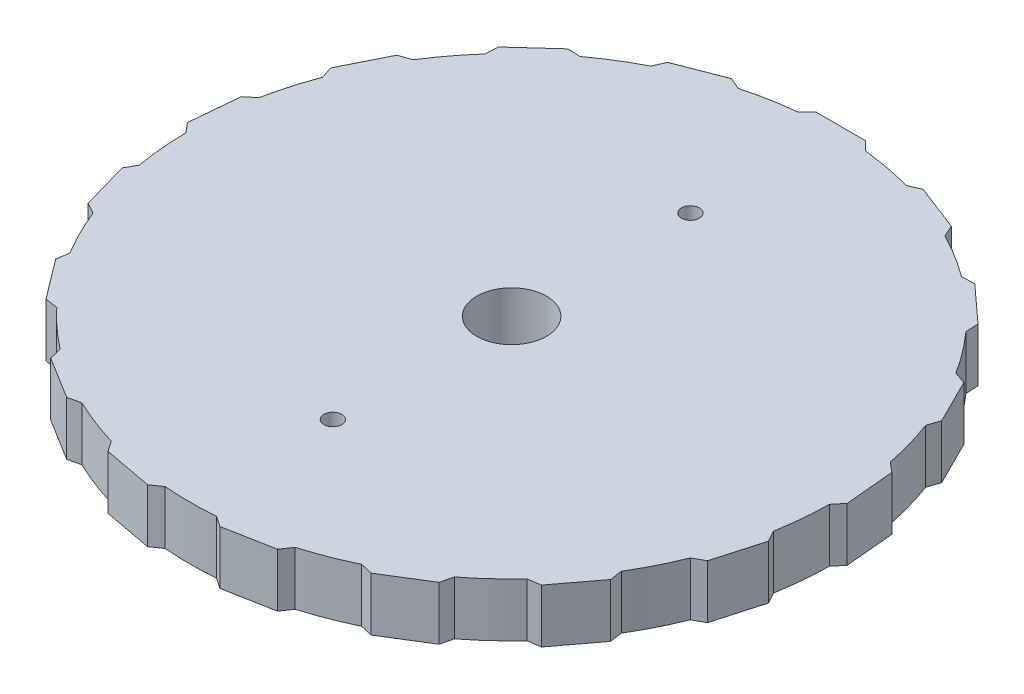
ISO-10303-21;
HEADER;
FILE_DESCRIPTION(('STEP AP214'),'2;1');
FILE_NAME('part.step','',(''),(''),'','','');
FILE_SCHEMA(('AUTOMOTIVE_DESIGN { 1 0 10303 214 1 1 1 1 }'));
ENDSEC;
DATA;
#1=APPLICATION_CONTEXT('core data for automotive mechanical design processes');
#2=APPLICATION_PROTOCOL_DEFINITION('international standard','automotive_design',2000,#1);
#3=PRODUCT_CONTEXT('',#1,'mechanical');
#4=PRODUCT('Part','Part','',(#3));
#5=PRODUCT_RELATED_PRODUCT_CATEGORY('part','',(#4));
#6=PRODUCT_DEFINITION_FORMATION('','',#4);
#7=PRODUCT_DEFINITION_CONTEXT('part definition',#1,'design');
#8=PRODUCT_DEFINITION('design','',#6,#7);
#9=PRODUCT_DEFINITION_SHAPE('','',#8);
#10=(LENGTH_UNIT() NAMED_UNIT(*) SI_UNIT(.MILLI.,.METRE.));
#11=(NAMED_UNIT(*) PLANE_ANGLE_UNIT() SI_UNIT($,.RADIAN.));
#12=(NAMED_UNIT(*) SI_UNIT($,.STERADIAN.) SOLID_ANGLE_UNIT());
#13=UNCERTAINTY_MEASURE_WITH_UNIT(LENGTH_MEASURE(1.E-05),#10,'distance_accuracy_value','');
#14=(GEOMETRIC_REPRESENTATION_CONTEXT(3) GLOBAL_UNCERTAINTY_ASSIGNED_CONTEXT((#13)) GLOBAL_UNIT_ASSIGNED_CONTEXT((#10,
#11,#12)) REPRESENTATION_CONTEXT('',''));
#15=CARTESIAN_POINT('',(0.,0.,0.));
#16=DIRECTION('',(0.,0.,1.));
#17=DIRECTION('',(1.,0.,0.));
#18=AXIS2_PLACEMENT_3D('',#15,#16,#17);
#19=CARTESIAN_POINT('',(0.,3.,0.));
#20=DIRECTION('',(0.,-1.,0.));
#21=DIRECTION('',(0.,0.,-1.));
#22=AXIS2_PLACEMENT_3D('',#19,#20,#21);
#23=CYLINDRICAL_SURFACE('',#22,18.);
#24=DIRECTION('',(0.,-1.,0.));
#25=VECTOR('',#24,1.);
#26=CARTESIAN_POINT('',(-8.22118744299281,3.,-16.0128722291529));
#27=LINE('',#26,#25);
#28=CARTESIAN_POINT('',(-8.22118744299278,3.,-16.012872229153));
#29=VERTEX_POINT('',#28);
#30=CARTESIAN_POINT('',(-8.22118744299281,0.,-16.0128722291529));
#31=VERTEX_POINT('',#30);
#32=EDGE_CURVE('E492',#29,#31,#27,.T.);
#33=ORIENTED_EDGE('',*,*,#32,.T.);
#34=CARTESIAN_POINT('',(0.,0.,0.));
#35=DIRECTION('',(0.,1.,0.));
#36=DIRECTION('',(0.,0.,1.));
#37=AXIS2_PLACEMENT_3D('',#34,#35,#36);
#38=CIRCLE('',#37,18.);
#39=CARTESIAN_POINT('',(-10.6696368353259,0.,-14.496856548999));
#40=VERTEX_POINT('',#39);
#41=EDGE_CURVE('E975',#31,#40,#38,.T.);
#42=ORIENTED_EDGE('',*,*,#41,.T.);
#43=DIRECTION('',(0.,-1.,0.));
#44=VECTOR('',#43,1.);
#45=CARTESIAN_POINT('',(-10.6696368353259,3.,-14.496856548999));
#46=LINE('',#45,#44);
#47=CARTESIAN_POINT('',(-10.6696368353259,3.,-14.496856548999));
#48=VERTEX_POINT('',#47);
#49=EDGE_CURVE('E514',#48,#40,#46,.T.);
#50=ORIENTED_EDGE('',*,*,#49,.F.);
#51=CARTESIAN_POINT('',(0.,3.,0.));
#52=DIRECTION('',(0.,1.,0.));
#53=DIRECTION('',(0.,0.,1.));
#54=AXIS2_PLACEMENT_3D('',#51,#52,#53);
#55=CIRCLE('',#54,18.);
#56=EDGE_CURVE('E42',#29,#48,#55,.T.);
#57=ORIENTED_EDGE('',*,*,#56,.F.);
#58=EDGE_LOOP('',(#33,#42,#50,#57));
#59=FACE_BOUND('',#58,.T.);
#60=ADVANCED_FACE('F33',(#59),#23,.T.);
#61=DIRECTION('',(0.,-1.,0.));
#62=VECTOR('',#61,1.);
#63=CARTESIAN_POINT('',(-4.71227143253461,3.,-17.3722335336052));
#64=LINE('',#63,#62);
#65=CARTESIAN_POINT('',(-4.71227143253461,3.,-17.3722335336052));
#66=VERTEX_POINT('',#65);
#67=CARTESIAN_POINT('',(-4.71227143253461,0.,-17.3722335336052));
#68=VERTEX_POINT('',#67);
#69=EDGE_CURVE('E57',#66,#68,#64,.T.);
#70=ORIENTED_EDGE('',*,*,#69,.F.);
#71=CARTESIAN_POINT('',(-1.88151233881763,3.,-17.9013941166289));
#72=VERTEX_POINT('',#71);
#73=EDGE_CURVE('E11',#72,#66,#55,.T.);
#74=ORIENTED_EDGE('',*,*,#73,.F.);
#75=DIRECTION('',(0.,-1.,0.));
#76=VECTOR('',#75,1.);
#77=CARTESIAN_POINT('',(-1.88151233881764,3.,-17.9013941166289));
#78=LINE('',#77,#76);
#79=CARTESIAN_POINT('',(-1.88151233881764,0.,-17.9013941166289));
#80=VERTEX_POINT('',#79);
#81=EDGE_CURVE('E906',#72,#80,#78,.T.);
#82=ORIENTED_EDGE('',*,*,#81,.T.);
#83=EDGE_CURVE('E37',#80,#68,#38,.T.);
#84=ORIENTED_EDGE('',*,*,#83,.T.);
#85=EDGE_LOOP('',(#70,#74,#82,#84));
#86=FACE_BOUND('',#85,.T.);
#87=ADVANCED_FACE('F947',(#86),#23,.T.);
#88=DIRECTION('',(0.,-1.,0.));
#89=VECTOR('',#88,1.);
#90=CARTESIAN_POINT('',(-13.4505456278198,3.,-11.9617232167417));
#91=LINE('',#90,#89);
#92=CARTESIAN_POINT('',(-13.4505456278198,3.,-11.9617232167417));
#93=VERTEX_POINT('',#92);
#94=CARTESIAN_POINT('',(-13.4505456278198,0.,-11.9617232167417));
#95=VERTEX_POINT('',#94);
#96=EDGE_CURVE('E517',#93,#95,#91,.T.);
#97=ORIENTED_EDGE('',*,*,#96,.T.);
#98=CARTESIAN_POINT('',(-15.1860086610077,0.,-9.66359875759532));
#99=VERTEX_POINT('',#98);
#100=EDGE_CURVE('E977',#95,#99,#38,.T.);
#101=ORIENTED_EDGE('',*,*,#100,.T.);
#102=DIRECTION('',(0.,-1.,0.));
#103=VECTOR('',#102,1.);
#104=CARTESIAN_POINT('',(-15.1860086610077,3.,-9.66359875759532));
#105=LINE('',#104,#103);
#106=CARTESIAN_POINT('',(-15.1860086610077,3.,-9.66359875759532));
#107=VERTEX_POINT('',#106);
#108=EDGE_CURVE('E540',#107,#99,#105,.T.);
#109=ORIENTED_EDGE('',*,*,#108,.F.);
#110=EDGE_CURVE('E1046',#93,#107,#55,.T.);
#111=ORIENTED_EDGE('',*,*,#110,.F.);
#112=EDGE_LOOP('',(#97,#101,#109,#111));
#113=FACE_BOUND('',#112,.T.);
#114=ADVANCED_FACE('F951',(#113),#23,.T.);
#115=DIRECTION('',(0.,-1.,0.));
#116=VECTOR('',#115,1.);
#117=CARTESIAN_POINT('',(-16.8633330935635,3.,-6.29507720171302));
#118=LINE('',#117,#116);
#119=CARTESIAN_POINT('',(-16.8633330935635,3.,-6.29507720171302));
#120=VERTEX_POINT('',#119);
#121=CARTESIAN_POINT('',(-16.8633330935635,0.,-6.29507720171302));
#122=VERTEX_POINT('',#121);
#123=EDGE_CURVE('E543',#120,#122,#118,.T.);
#124=ORIENTED_EDGE('',*,*,#123,.T.);
#125=CARTESIAN_POINT('',(-17.6514258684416,0.,-3.52521840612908));
#126=VERTEX_POINT('',#125);
#127=EDGE_CURVE('E978',#122,#126,#38,.T.);
#128=ORIENTED_EDGE('',*,*,#127,.T.);
#129=DIRECTION('',(0.,-1.,0.));
#130=VECTOR('',#129,1.);
#131=CARTESIAN_POINT('',(-17.6514258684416,3.,-3.52521840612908));
#132=LINE('',#131,#130);
#133=CARTESIAN_POINT('',(-17.6514258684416,3.,-3.52521840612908));
#134=VERTEX_POINT('',#133);
#135=EDGE_CURVE('E566',#134,#126,#132,.T.);
#136=ORIENTED_EDGE('',*,*,#135,.F.);
#137=EDGE_CURVE('E1045',#120,#134,#55,.T.);
#138=ORIENTED_EDGE('',*,*,#137,.F.);
#139=EDGE_LOOP('',(#124,#128,#136,#138));
#140=FACE_BOUND('',#139,.T.);
#141=ADVANCED_FACE('F1078',(#140),#23,.T.);
#142=DIRECTION('',(0.,-1.,0.));
#143=VECTOR('',#142,1.);
#144=CARTESIAN_POINT('',(-17.998633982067,3.,0.22175387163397));
#145=LINE('',#144,#143);
#146=CARTESIAN_POINT('',(-17.998633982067,3.,0.221753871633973));
#147=VERTEX_POINT('',#146);
#148=CARTESIAN_POINT('',(-17.998633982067,0.,0.22175387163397));
#149=VERTEX_POINT('',#148);
#150=EDGE_CURVE('E569',#147,#149,#145,.T.);
#151=ORIENTED_EDGE('',*,*,#150,.T.);
#152=CARTESIAN_POINT('',(-17.7329202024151,0.,3.08926222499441));
#153=VERTEX_POINT('',#152);
#154=EDGE_CURVE('E981',#149,#153,#38,.T.);
#155=ORIENTED_EDGE('',*,*,#154,.T.);
#156=DIRECTION('',(0.,-1.,0.));
#157=VECTOR('',#156,1.);
#158=CARTESIAN_POINT('',(-17.7329202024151,3.,3.08926222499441));
#159=LINE('',#158,#157);
#160=CARTESIAN_POINT('',(-17.7329202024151,3.,3.08926222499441));
#161=VERTEX_POINT('',#160);
#162=EDGE_CURVE('E592',#161,#153,#159,.T.);
#163=ORIENTED_EDGE('',*,*,#162,.F.);
#164=EDGE_CURVE('E1044',#147,#161,#55,.T.);
#165=ORIENTED_EDGE('',*,*,#164,.F.);
#166=EDGE_LOOP('',(#151,#155,#163,#165));
#167=FACE_BOUND('',#166,.T.);
#168=ADVANCED_FACE('F1094',(#167),#23,.T.);
#169=DIRECTION('',(0.,-1.,0.));
#170=VECTOR('',#169,1.);
#171=CARTESIAN_POINT('',(-16.7031196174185,3.,6.70863585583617));
#172=LINE('',#171,#170);
#173=CARTESIAN_POINT('',(-16.7031196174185,3.,6.70863585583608));
#174=VERTEX_POINT('',#173);
#175=CARTESIAN_POINT('',(-16.7031196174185,0.,6.70863585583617));
#176=VERTEX_POINT('',#175);
#177=EDGE_CURVE('E595',#174,#176,#172,.T.);
#178=ORIENTED_EDGE('',*,*,#177,.T.);
#179=CARTESIAN_POINT('',(-15.4194854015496,0.,9.28652087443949));
#180=VERTEX_POINT('',#179);
#181=EDGE_CURVE('E984',#176,#180,#38,.T.);
#182=ORIENTED_EDGE('',*,*,#181,.T.);
#183=DIRECTION('',(0.,-1.,0.));
#184=VECTOR('',#183,1.);
#185=CARTESIAN_POINT('',(-15.4194854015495,3.,9.28652087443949));
#186=LINE('',#185,#184);
#187=CARTESIAN_POINT('',(-15.4194854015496,3.,9.28652087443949));
#188=VERTEX_POINT('',#187);
#189=EDGE_CURVE('E618',#188,#180,#186,.T.);
#190=ORIENTED_EDGE('',*,*,#189,.F.);
#191=EDGE_CURVE('E1043',#174,#188,#55,.T.);
#192=ORIENTED_EDGE('',*,*,#191,.F.);
#193=EDGE_LOOP('',(#178,#182,#190,#192));
#194=FACE_BOUND('',#193,.T.);
#195=ADVANCED_FACE('F1110',(#194),#23,.T.);
#196=DIRECTION('',(0.,-1.,0.));
#197=VECTOR('',#196,1.);
#198=CARTESIAN_POINT('',(-13.1517563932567,3.,12.2894793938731));
#199=LINE('',#198,#197);
#200=CARTESIAN_POINT('',(-13.1517563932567,3.,12.2894793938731));
#201=VERTEX_POINT('',#200);
#202=CARTESIAN_POINT('',(-13.1517563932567,0.,12.2894793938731));
#203=VERTEX_POINT('',#202);
#204=EDGE_CURVE('E621',#201,#203,#199,.T.);
#205=ORIENTED_EDGE('',*,*,#204,.T.);
#206=CARTESIAN_POINT('',(-11.0235636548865,0.,14.2295834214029));
#207=VERTEX_POINT('',#206);
#208=EDGE_CURVE('E987',#203,#207,#38,.T.);
#209=ORIENTED_EDGE('',*,*,#208,.T.);
#210=DIRECTION('',(0.,-1.,0.));
#211=VECTOR('',#210,1.);
#212=CARTESIAN_POINT('',(-11.0235636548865,3.,14.2295834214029));
#213=LINE('',#212,#211);
#214=CARTESIAN_POINT('',(-11.0235636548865,3.,14.2295834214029));
#215=VERTEX_POINT('',#214);
#216=EDGE_CURVE('E644',#215,#207,#213,.T.);
#217=ORIENTED_EDGE('',*,*,#216,.F.);
#218=EDGE_CURVE('E1042',#201,#215,#55,.T.);
#219=ORIENTED_EDGE('',*,*,#218,.F.);
#220=EDGE_LOOP('',(#205,#209,#217,#219));
#221=FACE_BOUND('',#220,.T.);
#222=ADVANCED_FACE('F1126',(#221),#23,.T.);
#223=DIRECTION('',(0.,-1.,0.));
#224=VECTOR('',#223,1.);
#225=CARTESIAN_POINT('',(-7.82417559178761,3.,16.2105606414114));
#226=LINE('',#225,#224);
#227=CARTESIAN_POINT('',(-7.82417559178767,3.,16.2105606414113));
#228=VERTEX_POINT('',#227);
#229=CARTESIAN_POINT('',(-7.82417559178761,0.,16.2105606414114));
#230=VERTEX_POINT('',#229);
#231=EDGE_CURVE('E647',#228,#230,#226,.T.);
#232=ORIENTED_EDGE('',*,*,#231,.T.);
#233=CARTESIAN_POINT('',(-5.13884855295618,0.,17.2508618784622));
#234=VERTEX_POINT('',#233);
#235=EDGE_CURVE('E990',#230,#234,#38,.T.);
#236=ORIENTED_EDGE('',*,*,#235,.T.);
#237=DIRECTION('',(0.,-1.,0.));
#238=VECTOR('',#237,1.);
#239=CARTESIAN_POINT('',(-5.13884855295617,3.,17.2508618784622));
#240=LINE('',#239,#238);
#241=CARTESIAN_POINT('',(-5.13884855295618,3.,17.2508618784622));
#242=VERTEX_POINT('',#241);
#243=EDGE_CURVE('E670',#242,#234,#240,.T.);
#244=ORIENTED_EDGE('',*,*,#243,.F.);
#245=EDGE_CURVE('E1041',#228,#242,#55,.T.);
#246=ORIENTED_EDGE('',*,*,#245,.F.);
#247=EDGE_LOOP('',(#232,#236,#244,#246));
#248=FACE_BOUND('',#247,.T.);
#249=ADVANCED_FACE('F1142',(#248),#23,.T.);
#250=DIRECTION('',(0.,-1.,0.));
#251=VECTOR('',#250,1.);
#252=CARTESIAN_POINT('',(-1.43989652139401,3.,17.9423158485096));
#253=LINE('',#252,#251);
#254=CARTESIAN_POINT('',(-1.4398965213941,3.,17.9423158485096));
#255=VERTEX_POINT('',#254);
#256=CARTESIAN_POINT('',(-1.43989652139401,0.,17.9423158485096));
#257=VERTEX_POINT('',#256);
#258=EDGE_CURVE('E673',#255,#257,#253,.T.);
#259=ORIENTED_EDGE('',*,*,#258,.T.);
#260=CARTESIAN_POINT('',(1.43989652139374,0.,17.9423158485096));
#261=VERTEX_POINT('',#260);
#262=EDGE_CURVE('E993',#257,#261,#38,.T.);
#263=ORIENTED_EDGE('',*,*,#262,.T.);
#264=DIRECTION('',(0.,-1.,0.));
#265=VECTOR('',#264,1.);
#266=CARTESIAN_POINT('',(1.43989652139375,3.,17.9423158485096));
#267=LINE('',#266,#265);
#268=CARTESIAN_POINT('',(1.43989652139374,3.,17.9423158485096));
#269=VERTEX_POINT('',#268);
#270=EDGE_CURVE('E696',#269,#261,#267,.T.);
#271=ORIENTED_EDGE('',*,*,#270,.F.);
#272=EDGE_CURVE('E1040',#255,#269,#55,.T.);
#273=ORIENTED_EDGE('',*,*,#272,.F.);
#274=EDGE_LOOP('',(#259,#263,#271,#273));
#275=FACE_BOUND('',#274,.T.);
#276=ADVANCED_FACE('F1158',(#275),#23,.T.);
#277=DIRECTION('',(0.,-1.,0.));
#278=VECTOR('',#277,1.);
#279=CARTESIAN_POINT('',(5.13884855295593,3.,17.2508618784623));
#280=LINE('',#279,#278);
#281=CARTESIAN_POINT('',(5.13884855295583,3.,17.2508618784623));
#282=VERTEX_POINT('',#281);
#283=CARTESIAN_POINT('',(5.13884855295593,0.,17.2508618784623));
#284=VERTEX_POINT('',#283);
#285=EDGE_CURVE('E699',#282,#284,#280,.T.);
#286=ORIENTED_EDGE('',*,*,#285,.T.);
#287=CARTESIAN_POINT('',(7.82417559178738,0.,16.2105606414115));
#288=VERTEX_POINT('',#287);
#289=EDGE_CURVE('E996',#284,#288,#38,.T.);
#290=ORIENTED_EDGE('',*,*,#289,.T.);
#291=DIRECTION('',(0.,-1.,0.));
#292=VECTOR('',#291,1.);
#293=CARTESIAN_POINT('',(7.82417559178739,3.,16.2105606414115));
#294=LINE('',#293,#292);
#295=CARTESIAN_POINT('',(7.82417559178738,3.,16.2105606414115));
#296=VERTEX_POINT('',#295);
#297=EDGE_CURVE('E722',#296,#288,#294,.T.);
#298=ORIENTED_EDGE('',*,*,#297,.F.);
#299=EDGE_CURVE('E1039',#282,#296,#55,.T.);
#300=ORIENTED_EDGE('',*,*,#299,.F.);
#301=EDGE_LOOP('',(#286,#290,#298,#300));
#302=FACE_BOUND('',#301,.T.);
#303=ADVANCED_FACE('F1174',(#302),#23,.T.);
#304=DIRECTION('',(0.,-1.,0.));
#305=VECTOR('',#304,1.);
#306=CARTESIAN_POINT('',(11.0235636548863,3.,14.2295834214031));
#307=LINE('',#306,#305);
#308=CARTESIAN_POINT('',(11.0235636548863,3.,14.2295834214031));
#309=VERTEX_POINT('',#308);
#310=CARTESIAN_POINT('',(11.0235636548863,0.,14.2295834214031));
#311=VERTEX_POINT('',#310);
#312=EDGE_CURVE('E725',#309,#311,#307,.T.);
#313=ORIENTED_EDGE('',*,*,#312,.T.);
#314=CARTESIAN_POINT('',(13.1517563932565,0.,12.2894793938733));
#315=VERTEX_POINT('',#314);
#316=EDGE_CURVE('E999',#311,#315,#38,.T.);
#317=ORIENTED_EDGE('',*,*,#316,.T.);
#318=DIRECTION('',(0.,-1.,0.));
#319=VECTOR('',#318,1.);
#320=CARTESIAN_POINT('',(13.1517563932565,3.,12.2894793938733));
#321=LINE('',#320,#319);
#322=CARTESIAN_POINT('',(13.1517563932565,3.,12.2894793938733));
#323=VERTEX_POINT('',#322);
#324=EDGE_CURVE('E748',#323,#315,#321,.T.);
#325=ORIENTED_EDGE('',*,*,#324,.F.);
#326=EDGE_CURVE('E1038',#309,#323,#55,.T.);
#327=ORIENTED_EDGE('',*,*,#326,.F.);
#328=EDGE_LOOP('',(#313,#317,#325,#327));
#329=FACE_BOUND('',#328,.T.);
#330=ADVANCED_FACE('F1190',(#329),#23,.T.);
#331=DIRECTION('',(0.,-1.,0.));
#332=VECTOR('',#331,1.);
#333=CARTESIAN_POINT('',(15.4194854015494,3.,9.2865208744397));
#334=LINE('',#333,#332);
#335=CARTESIAN_POINT('',(15.4194854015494,3.,9.28652087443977));
#336=VERTEX_POINT('',#335);
#337=CARTESIAN_POINT('',(15.4194854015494,0.,9.2865208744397));
#338=VERTEX_POINT('',#337);
#339=EDGE_CURVE('E751',#336,#338,#334,.T.);
#340=ORIENTED_EDGE('',*,*,#339,.T.);
#341=CARTESIAN_POINT('',(16.7031196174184,0.,6.70863585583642));
#342=VERTEX_POINT('',#341);
#343=EDGE_CURVE('E1002',#338,#342,#38,.T.);
#344=ORIENTED_EDGE('',*,*,#343,.T.);
#345=DIRECTION('',(0.,-1.,0.));
#346=VECTOR('',#345,1.);
#347=CARTESIAN_POINT('',(16.7031196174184,3.,6.70863585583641));
#348=LINE('',#347,#346);
#349=CARTESIAN_POINT('',(16.7031196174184,3.,6.70863585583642));
#350=VERTEX_POINT('',#349);
#351=EDGE_CURVE('E774',#350,#342,#348,.T.);
#352=ORIENTED_EDGE('',*,*,#351,.F.);
#353=EDGE_CURVE('E1037',#336,#350,#55,.T.);
#354=ORIENTED_EDGE('',*,*,#353,.F.);
#355=EDGE_LOOP('',(#340,#344,#352,#354));
#356=FACE_BOUND('',#355,.T.);
#357=ADVANCED_FACE('F1206',(#356),#23,.T.);
#358=DIRECTION('',(0.,-1.,0.));
#359=VECTOR('',#358,1.);
#360=CARTESIAN_POINT('',(17.7329202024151,3.,3.08926222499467));
#361=LINE('',#360,#359);
#362=CARTESIAN_POINT('',(17.7329202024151,3.,3.08926222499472));
#363=VERTEX_POINT('',#362);
#364=CARTESIAN_POINT('',(17.7329202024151,0.,3.08926222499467));
#365=VERTEX_POINT('',#364);
#366=EDGE_CURVE('E777',#363,#365,#361,.T.);
#367=ORIENTED_EDGE('',*,*,#366,.T.);
#368=CARTESIAN_POINT('',(17.998633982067,0.,0.22175387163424));
#369=VERTEX_POINT('',#368);
#370=EDGE_CURVE('E1005',#365,#369,#38,.T.);
#371=ORIENTED_EDGE('',*,*,#370,.T.);
#372=DIRECTION('',(0.,-1.,0.));
#373=VECTOR('',#372,1.);
#374=CARTESIAN_POINT('',(17.998633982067,3.,0.221753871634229));
#375=LINE('',#374,#373);
#376=CARTESIAN_POINT('',(17.998633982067,3.,0.22175387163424));
#377=VERTEX_POINT('',#376);
#378=EDGE_CURVE('E800',#377,#369,#375,.T.);
#379=ORIENTED_EDGE('',*,*,#378,.F.);
#380=EDGE_CURVE('E1036',#363,#377,#55,.T.);
#381=ORIENTED_EDGE('',*,*,#380,.F.);
#382=EDGE_LOOP('',(#367,#371,#379,#381));
#383=FACE_BOUND('',#382,.T.);
#384=ADVANCED_FACE('F1222',(#383),#23,.T.);
#385=DIRECTION('',(0.,-1.,0.));
#386=VECTOR('',#385,1.);
#387=CARTESIAN_POINT('',(17.6514258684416,3.,-3.52521840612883));
#388=LINE('',#387,#386);
#389=CARTESIAN_POINT('',(17.6514258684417,3.,-3.52521840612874));
#390=VERTEX_POINT('',#389);
#391=CARTESIAN_POINT('',(17.6514258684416,0.,-3.52521840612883));
#392=VERTEX_POINT('',#391);
#393=EDGE_CURVE('E803',#390,#392,#388,.T.);
#394=ORIENTED_EDGE('',*,*,#393,.T.);
#395=CARTESIAN_POINT('',(16.8633330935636,0.,-6.29507720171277));
#396=VERTEX_POINT('',#395);
#397=EDGE_CURVE('E1008',#392,#396,#38,.T.);
#398=ORIENTED_EDGE('',*,*,#397,.T.);
#399=DIRECTION('',(0.,-1.,0.));
#400=VECTOR('',#399,1.);
#401=CARTESIAN_POINT('',(16.8633330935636,3.,-6.29507720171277));
#402=LINE('',#401,#400);
#403=CARTESIAN_POINT('',(16.8633330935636,3.,-6.29507720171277));
#404=VERTEX_POINT('',#403);
#405=EDGE_CURVE('E826',#404,#396,#402,.T.);
#406=ORIENTED_EDGE('',*,*,#405,.F.);
#407=EDGE_CURVE('E1035',#390,#404,#55,.T.);
#408=ORIENTED_EDGE('',*,*,#407,.F.);
#409=EDGE_LOOP('',(#394,#398,#406,#408));
#410=FACE_BOUND('',#409,.T.);
#411=ADVANCED_FACE('F1238',(#410),#23,.T.);
#412=DIRECTION('',(0.,-1.,0.));
#413=VECTOR('',#412,1.);
#414=CARTESIAN_POINT('',(15.1860086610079,3.,-9.6635987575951));
#415=LINE('',#414,#413);
#416=CARTESIAN_POINT('',(15.1860086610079,3.,-9.66359875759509));
#417=VERTEX_POINT('',#416);
#418=CARTESIAN_POINT('',(15.1860086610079,0.,-9.6635987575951));
#419=VERTEX_POINT('',#418);
#420=EDGE_CURVE('E829',#417,#419,#415,.T.);
#421=ORIENTED_EDGE('',*,*,#420,.T.);
#422=CARTESIAN_POINT('',(13.45054562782,0.,-11.9617232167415));
#423=VERTEX_POINT('',#422);
#424=EDGE_CURVE('E974',#419,#423,#38,.T.);
#425=ORIENTED_EDGE('',*,*,#424,.T.);
#426=DIRECTION('',(0.,-1.,0.));
#427=VECTOR('',#426,1.);
#428=CARTESIAN_POINT('',(13.45054562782,3.,-11.9617232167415));
#429=LINE('',#428,#427);
#430=CARTESIAN_POINT('',(13.45054562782,3.,-11.9617232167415));
#431=VERTEX_POINT('',#430);
#432=EDGE_CURVE('E852',#431,#423,#429,.T.);
#433=ORIENTED_EDGE('',*,*,#432,.F.);
#434=EDGE_CURVE('E1033',#417,#431,#55,.T.);
#435=ORIENTED_EDGE('',*,*,#434,.F.);
#436=EDGE_LOOP('',(#421,#425,#433,#435));
#437=FACE_BOUND('',#436,.T.);
#438=ADVANCED_FACE('F959',(#437),#23,.T.);
#439=DIRECTION('',(0.,-1.,0.));
#440=VECTOR('',#439,1.);
#441=CARTESIAN_POINT('',(10.6696368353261,3.,-14.4968565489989));
#442=LINE('',#441,#440);
#443=CARTESIAN_POINT('',(10.6696368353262,3.,-14.4968565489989));
#444=VERTEX_POINT('',#443);
#445=CARTESIAN_POINT('',(10.6696368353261,0.,-14.4968565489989));
#446=VERTEX_POINT('',#445);
#447=EDGE_CURVE('E855',#444,#446,#442,.T.);
#448=ORIENTED_EDGE('',*,*,#447,.T.);
#449=CARTESIAN_POINT('',(8.22118744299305,0.,-16.0128722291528));
#450=VERTEX_POINT('',#449);
#451=EDGE_CURVE('E973',#446,#450,#38,.T.);
#452=ORIENTED_EDGE('',*,*,#451,.T.);
#453=DIRECTION('',(0.,-1.,0.));
#454=VECTOR('',#453,1.);
#455=CARTESIAN_POINT('',(8.22118744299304,3.,-16.0128722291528));
#456=LINE('',#455,#454);
#457=CARTESIAN_POINT('',(8.22118744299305,3.,-16.0128722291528));
#458=VERTEX_POINT('',#457);
#459=EDGE_CURVE('E878',#458,#450,#456,.T.);
#460=ORIENTED_EDGE('',*,*,#459,.F.);
#461=EDGE_CURVE('E976',#444,#458,#55,.T.);
#462=ORIENTED_EDGE('',*,*,#461,.F.);
#463=EDGE_LOOP('',(#448,#452,#460,#462));
#464=FACE_BOUND('',#463,.T.);
#465=ADVANCED_FACE('F953',(#464),#23,.T.);
#466=DIRECTION('',(0.,-1.,0.));
#467=VECTOR('',#466,1.);
#468=CARTESIAN_POINT('',(4.71227143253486,3.,-17.3722335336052));
#469=LINE('',#468,#467);
#470=CARTESIAN_POINT('',(4.71227143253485,3.,-17.3722335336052));
#471=VERTEX_POINT('',#470);
#472=CARTESIAN_POINT('',(4.71227143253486,0.,-17.3722335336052));
#473=VERTEX_POINT('',#472);
#474=EDGE_CURVE('E881',#471,#473,#469,.T.);
#475=ORIENTED_EDGE('',*,*,#474,.T.);
#476=CARTESIAN_POINT('',(1.88151233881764,0.,-17.9013941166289));
#477=VERTEX_POINT('',#476);
#478=EDGE_CURVE('E925',#473,#477,#38,.T.);
#479=ORIENTED_EDGE('',*,*,#478,.T.);
#480=DIRECTION('',(0.,-1.,0.));
#481=VECTOR('',#480,1.);
#482=CARTESIAN_POINT('',(1.88151233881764,3.,-17.9013941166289));
#483=LINE('',#482,#481);
#484=CARTESIAN_POINT('',(1.88151233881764,3.,-17.9013941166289));
#485=VERTEX_POINT('',#484);
#486=EDGE_CURVE('E903',#485,#477,#483,.T.);
#487=ORIENTED_EDGE('',*,*,#486,.F.);
#488=EDGE_CURVE('E43',#471,#485,#55,.T.);
#489=ORIENTED_EDGE('',*,*,#488,.F.);
#490=EDGE_LOOP('',(#475,#479,#487,#489));
#491=FACE_BOUND('',#490,.T.);
#492=ADVANCED_FACE('F35',(#491),#23,.T.);
#493=CARTESIAN_POINT('',(0.,3.,0.));
#494=DIRECTION('',(0.,1.,0.));
#495=DIRECTION('',(0.,0.,1.));
#496=AXIS2_PLACEMENT_3D('',#493,#494,#495);
#497=PLANE('',#496);
#498=ORIENTED_EDGE('',*,*,#73,.T.);
#499=DIRECTION('',(-0.914793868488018,0.,-0.403921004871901));
#500=VECTOR('',#499,1.);
#501=CARTESIAN_POINT('',(-4.71227143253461,3.,-17.3722335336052));
#502=LINE('',#501,#500);
#503=CARTESIAN_POINT('',(-5.35912838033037,3.,-17.6578488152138));
#504=VERTEX_POINT('',#503);
#505=EDGE_CURVE('E458',#66,#504,#502,.T.);
#506=ORIENTED_EDGE('',*,*,#505,.T.);
#507=DIRECTION('',(-0.93247222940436,0.,0.361241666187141));
#508=VECTOR('',#507,1.);
#509=CARTESIAN_POINT('',(-7.9355721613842,3.,-16.6597291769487));
#510=LINE('',#509,#508);
#511=CARTESIAN_POINT('',(-7.9355721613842,3.,-16.6597291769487));
#512=VERTEX_POINT('',#511);
#513=EDGE_CURVE('E463',#504,#512,#510,.T.);
#514=ORIENTED_EDGE('',*,*,#513,.T.);
#515=DIRECTION('',(-0.403921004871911,0.,0.914793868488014));
#516=VECTOR('',#515,1.);
#517=CARTESIAN_POINT('',(-7.9355721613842,3.,-16.6597291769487));
#518=LINE('',#517,#516);
#519=EDGE_CURVE('E467',#512,#29,#518,.T.);
#520=ORIENTED_EDGE('',*,*,#519,.T.);
#521=ORIENTED_EDGE('',*,*,#56,.T.);
#522=DIRECTION('',(-0.998932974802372,0.,-0.0461834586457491));
#523=VECTOR('',#522,1.);
#524=CARTESIAN_POINT('',(-10.6696368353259,3.,-14.496856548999));
#525=LINE('',#524,#523);
#526=CARTESIAN_POINT('',(-11.3759891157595,3.,-14.5295131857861));
#527=VERTEX_POINT('',#526);
#528=EDGE_CURVE('E498',#48,#527,#525,.T.);
#529=ORIENTED_EDGE('',*,*,#528,.T.);
#530=DIRECTION('',(-0.739008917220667,0.,0.673695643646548));
#531=VECTOR('',#530,1.);
#532=CARTESIAN_POINT('',(-13.4178889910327,3.,-12.6680754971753));
#533=LINE('',#532,#531);
#534=CARTESIAN_POINT('',(-13.4178889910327,3.,-12.6680754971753));
#535=VERTEX_POINT('',#534);
#536=EDGE_CURVE('E501',#527,#535,#533,.T.);
#537=ORIENTED_EDGE('',*,*,#536,.T.);
#538=DIRECTION('',(-0.0461834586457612,0.,0.998932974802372));
#539=VECTOR('',#538,1.);
#540=CARTESIAN_POINT('',(-13.4178889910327,3.,-12.6680754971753));
#541=LINE('',#540,#539);
#542=EDGE_CURVE('E495',#535,#93,#541,.T.);
#543=ORIENTED_EDGE('',*,*,#542,.T.);
#544=ORIENTED_EDGE('',*,*,#110,.T.);
#545=DIRECTION('',(-0.948160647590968,0.,0.317791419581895));
#546=VECTOR('',#545,1.);
#547=CARTESIAN_POINT('',(-15.1860086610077,3.,-9.66359875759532));
#548=LINE('',#547,#546);
#549=CARTESIAN_POINT('',(-15.8564594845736,3.,-9.43888628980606));
#550=VERTEX_POINT('',#549);
#551=EDGE_CURVE('E524',#107,#550,#548,.T.);
#552=ORIENTED_EDGE('',*,*,#551,.T.);
#553=DIRECTION('',(-0.445738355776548,0.,0.895163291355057));
#554=VECTOR('',#553,1.);
#555=CARTESIAN_POINT('',(-17.0880455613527,3.,-6.96552802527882));
#556=LINE('',#555,#554);
#557=CARTESIAN_POINT('',(-17.0880455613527,3.,-6.96552802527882));
#558=VERTEX_POINT('',#557);
#559=EDGE_CURVE('E527',#550,#558,#556,.T.);
#560=ORIENTED_EDGE('',*,*,#559,.T.);
#561=DIRECTION('',(0.317791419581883,0.,0.948160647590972));
#562=VECTOR('',#561,1.);
#563=CARTESIAN_POINT('',(-17.0880455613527,3.,-6.96552802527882));
#564=LINE('',#563,#562);
#565=EDGE_CURVE('E521',#558,#120,#564,.T.);
#566=ORIENTED_EDGE('',*,*,#565,.T.);
#567=ORIENTED_EDGE('',*,*,#137,.T.);
#568=DIRECTION('',(-0.769333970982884,0.,0.638846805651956));
#569=VECTOR('',#568,1.);
#570=CARTESIAN_POINT('',(-17.6514258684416,3.,-3.52521840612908));
#571=LINE('',#570,#569);
#572=CARTESIAN_POINT('',(-18.1954271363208,3.,-3.07348549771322));
#573=VERTEX_POINT('',#572);
#574=EDGE_CURVE('E550',#134,#573,#571,.T.);
#575=ORIENTED_EDGE('',*,*,#574,.T.);
#576=DIRECTION('',(-0.0922683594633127,0.,0.995734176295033));
#577=VECTOR('',#576,1.);
#578=CARTESIAN_POINT('',(-18.4503668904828,3.,-0.322247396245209));
#579=LINE('',#578,#577);
#580=CARTESIAN_POINT('',(-18.4503668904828,3.,-0.322247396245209));
#581=VERTEX_POINT('',#580);
#582=EDGE_CURVE('E553',#573,#581,#579,.T.);
#583=ORIENTED_EDGE('',*,*,#582,.T.);
#584=DIRECTION('',(0.638846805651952,0.,0.769333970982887));
#585=VECTOR('',#584,1.);
#586=CARTESIAN_POINT('',(-18.4503668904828,3.,-0.322247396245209));
#587=LINE('',#586,#585);
#588=EDGE_CURVE('E547',#581,#147,#587,.T.);
#589=ORIENTED_EDGE('',*,*,#588,.T.);
#590=ORIENTED_EDGE('',*,*,#164,.T.);
#591=DIRECTION('',(-0.48660447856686,0.,0.873622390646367));
#592=VECTOR('',#591,1.);
#593=CARTESIAN_POINT('',(-17.7329202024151,3.,3.08926222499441));
#594=LINE('',#593,#592);
#595=CARTESIAN_POINT('',(-18.0770015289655,3.,3.70700654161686));
#596=VERTEX_POINT('',#595);
#597=EDGE_CURVE('E576',#161,#596,#594,.T.);
#598=ORIENTED_EDGE('',*,*,#597,.T.);
#599=DIRECTION('',(0.273662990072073,0.,0.961825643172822));
#600=VECTOR('',#599,1.);
#601=CARTESIAN_POINT('',(-17.3208639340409,3.,6.36455452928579));
#602=LINE('',#601,#600);
#603=CARTESIAN_POINT('',(-17.3208639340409,3.,6.36455452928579));
#604=VERTEX_POINT('',#603);
#605=EDGE_CURVE('E579',#596,#604,#602,.T.);
#606=ORIENTED_EDGE('',*,*,#605,.T.);
#607=DIRECTION('',(0.873622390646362,0.,0.486604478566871));
#608=VECTOR('',#607,1.);
#609=CARTESIAN_POINT('',(-17.3208639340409,3.,6.36455452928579));
#610=LINE('',#609,#608);
#611=EDGE_CURVE('E573',#604,#174,#610,.T.);
#612=ORIENTED_EDGE('',*,*,#611,.T.);
#613=ORIENTED_EDGE('',*,*,#191,.T.);
#614=DIRECTION('',(-0.138156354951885,0.,0.990410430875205));
#615=VECTOR('',#614,1.);
#616=CARTESIAN_POINT('',(-15.4194854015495,3.,9.28652087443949));
#617=LINE('',#616,#615);
#618=CARTESIAN_POINT('',(-15.517176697,3.,9.98684680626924));
#619=VERTEX_POINT('',#618);
#620=EDGE_CURVE('E602',#188,#619,#617,.T.);
#621=ORIENTED_EDGE('',*,*,#620,.T.);
#622=DIRECTION('',(0.602634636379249,0.,0.798017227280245));
#623=VECTOR('',#622,1.);
#624=CARTESIAN_POINT('',(-13.8520823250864,3.,12.1917880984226));
#625=LINE('',#624,#623);
#626=CARTESIAN_POINT('',(-13.8520823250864,3.,12.1917880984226));
#627=VERTEX_POINT('',#626);
#628=EDGE_CURVE('E605',#619,#627,#625,.T.);
#629=ORIENTED_EDGE('',*,*,#628,.T.);
#630=DIRECTION('',(0.990410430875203,0.,0.138156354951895));
#631=VECTOR('',#630,1.);
#632=CARTESIAN_POINT('',(-13.8520823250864,3.,12.1917880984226));
#633=LINE('',#632,#631);
#634=EDGE_CURVE('E599',#627,#201,#633,.T.);
#635=ORIENTED_EDGE('',*,*,#634,.T.);
#636=ORIENTED_EDGE('',*,*,#218,.T.);
#637=DIRECTION('',(0.228950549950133,0.,0.973438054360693));
#638=VECTOR('',#637,1.);
#639=CARTESIAN_POINT('',(-11.0235636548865,3.,14.2295834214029));
#640=LINE('',#639,#638);
#641=CARTESIAN_POINT('',(-10.8616711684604,3.,14.9179080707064));
#642=VERTEX_POINT('',#641);
#643=EDGE_CURVE('E628',#215,#642,#640,.T.);
#644=ORIENTED_EDGE('',*,*,#643,.T.);
#645=DIRECTION('',(0.85021713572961,0.,0.526432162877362));
#646=VECTOR('',#645,1.);
#647=CARTESIAN_POINT('',(-8.51250024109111,3.,16.3724531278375));
#648=LINE('',#647,#646);
#649=CARTESIAN_POINT('',(-8.51250024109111,3.,16.3724531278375));
#650=VERTEX_POINT('',#649);
#651=EDGE_CURVE('E631',#642,#650,#648,.T.);
#652=ORIENTED_EDGE('',*,*,#651,.T.);
#653=DIRECTION('',(0.973438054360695,0.,-0.228950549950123));
#654=VECTOR('',#653,1.);
#655=CARTESIAN_POINT('',(-8.51250024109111,3.,16.3724531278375));
#656=LINE('',#655,#654);
#657=EDGE_CURVE('E625',#650,#228,#656,.T.);
#658=ORIENTED_EDGE('',*,*,#657,.T.);
#659=ORIENTED_EDGE('',*,*,#245,.T.);
#660=DIRECTION('',(0.565136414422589,0.,0.824997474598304));
#661=VECTOR('',#660,1.);
#662=CARTESIAN_POINT('',(-5.13884855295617,3.,17.2508618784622));
#663=LINE('',#662,#661);
#664=CARTESIAN_POINT('',(-4.7392367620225,3.,17.8342231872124));
#665=VERTEX_POINT('',#664);
#666=EDGE_CURVE('E654',#242,#665,#663,.T.);
#667=ORIENTED_EDGE('',*,*,#666,.T.);
#668=DIRECTION('',(0.982973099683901,0.,0.183749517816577));
#669=VECTOR('',#668,1.);
#670=CARTESIAN_POINT('',(-2.02325783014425,3.,18.3419276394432));
#671=LINE('',#670,#669);
#672=CARTESIAN_POINT('',(-2.02325783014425,3.,18.3419276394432));
#673=VERTEX_POINT('',#672);
#674=EDGE_CURVE('E657',#665,#673,#671,.T.);
#675=ORIENTED_EDGE('',*,*,#674,.T.);
#676=DIRECTION('',(0.824997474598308,0.,-0.565136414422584));
#677=VECTOR('',#676,1.);
#678=CARTESIAN_POINT('',(-2.02325783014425,3.,18.3419276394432));
#679=LINE('',#678,#677);
#680=EDGE_CURVE('E651',#673,#255,#679,.T.);
#681=ORIENTED_EDGE('',*,*,#680,.T.);
#682=ORIENTED_EDGE('',*,*,#272,.T.);
#683=DIRECTION('',(0.824997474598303,0.,0.565136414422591));
#684=VECTOR('',#683,1.);
#685=CARTESIAN_POINT('',(1.43989652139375,3.,17.9423158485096));
#686=LINE('',#685,#684);
#687=CARTESIAN_POINT('',(2.02325783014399,3.,18.3419276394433));
#688=VERTEX_POINT('',#687);
#689=EDGE_CURVE('E680',#269,#688,#686,.T.);
#690=ORIENTED_EDGE('',*,*,#689,.T.);
#691=DIRECTION('',(0.982973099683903,0.,-0.183749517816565));
#692=VECTOR('',#691,1.);
#693=CARTESIAN_POINT('',(4.73923676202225,3.,17.8342231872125));
#694=LINE('',#693,#692);
#695=CARTESIAN_POINT('',(4.73923676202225,3.,17.8342231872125));
#696=VERTEX_POINT('',#695);
#697=EDGE_CURVE('E683',#688,#696,#694,.T.);
#698=ORIENTED_EDGE('',*,*,#697,.T.);
#699=DIRECTION('',(0.565136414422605,0.,-0.824997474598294));
#700=VECTOR('',#699,1.);
#701=CARTESIAN_POINT('',(4.73923676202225,3.,17.8342231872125));
#702=LINE('',#701,#700);
#703=EDGE_CURVE('E677',#696,#282,#702,.T.);
#704=ORIENTED_EDGE('',*,*,#703,.T.);
#705=ORIENTED_EDGE('',*,*,#299,.T.);
#706=DIRECTION('',(0.973438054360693,0.,0.228950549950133));
#707=VECTOR('',#706,1.);
#708=CARTESIAN_POINT('',(7.82417559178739,3.,16.2105606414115));
#709=LINE('',#708,#707);
#710=CARTESIAN_POINT('',(8.51250024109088,3.,16.3724531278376));
#711=VERTEX_POINT('',#710);
#712=EDGE_CURVE('E706',#296,#711,#709,.T.);
#713=ORIENTED_EDGE('',*,*,#712,.T.);
#714=DIRECTION('',(0.850217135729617,0.,-0.52643216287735));
#715=VECTOR('',#714,1.);
#716=CARTESIAN_POINT('',(10.8616711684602,3.,14.9179080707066));
#717=LINE('',#716,#715);
#718=CARTESIAN_POINT('',(10.8616711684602,3.,14.9179080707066));
#719=VERTEX_POINT('',#718);
#720=EDGE_CURVE('E709',#711,#719,#717,.T.);
#721=ORIENTED_EDGE('',*,*,#720,.T.);
#722=DIRECTION('',(0.228950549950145,0.,-0.97343805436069));
#723=VECTOR('',#722,1.);
#724=CARTESIAN_POINT('',(10.8616711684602,3.,14.9179080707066));
#725=LINE('',#724,#723);
#726=EDGE_CURVE('E703',#719,#309,#725,.T.);
#727=ORIENTED_EDGE('',*,*,#726,.T.);
#728=ORIENTED_EDGE('',*,*,#326,.T.);
#729=DIRECTION('',(0.990410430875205,0.,-0.138156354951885));
#730=VECTOR('',#729,1.);
#731=CARTESIAN_POINT('',(13.1517563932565,3.,12.2894793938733));
#732=LINE('',#731,#730);
#733=CARTESIAN_POINT('',(13.8520823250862,3.,12.1917880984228));
#734=VERTEX_POINT('',#733);
#735=EDGE_CURVE('E732',#323,#734,#732,.T.);
#736=ORIENTED_EDGE('',*,*,#735,.T.);
#737=DIRECTION('',(0.602634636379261,0.,-0.798017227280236));
#738=VECTOR('',#737,1.);
#739=CARTESIAN_POINT('',(15.5171766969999,3.,9.98684680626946));
#740=LINE('',#739,#738);
#741=CARTESIAN_POINT('',(15.5171766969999,3.,9.98684680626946));
#742=VERTEX_POINT('',#741);
#743=EDGE_CURVE('E735',#734,#742,#740,.T.);
#744=ORIENTED_EDGE('',*,*,#743,.T.);
#745=DIRECTION('',(-0.138156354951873,0.,-0.990410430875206));
#746=VECTOR('',#745,1.);
#747=CARTESIAN_POINT('',(15.5171766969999,3.,9.98684680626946));
#748=LINE('',#747,#746);
#749=EDGE_CURVE('E729',#742,#336,#748,.T.);
#750=ORIENTED_EDGE('',*,*,#749,.T.);
#751=ORIENTED_EDGE('',*,*,#353,.T.);
#752=DIRECTION('',(0.87362239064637,0.,-0.486604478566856));
#753=VECTOR('',#752,1.);
#754=CARTESIAN_POINT('',(16.7031196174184,3.,6.70863585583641));
#755=LINE('',#754,#753);
#756=CARTESIAN_POINT('',(17.3208639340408,3.,6.36455452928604));
#757=VERTEX_POINT('',#756);
#758=EDGE_CURVE('E758',#350,#757,#755,.T.);
#759=ORIENTED_EDGE('',*,*,#758,.T.);
#760=DIRECTION('',(0.273662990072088,0.,-0.961825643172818));
#761=VECTOR('',#760,1.);
#762=CARTESIAN_POINT('',(18.0770015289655,3.,3.70700654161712));
#763=LINE('',#762,#761);
#764=CARTESIAN_POINT('',(18.0770015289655,3.,3.70700654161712));
#765=VERTEX_POINT('',#764);
#766=EDGE_CURVE('E761',#757,#765,#763,.T.);
#767=ORIENTED_EDGE('',*,*,#766,.T.);
#768=DIRECTION('',(-0.48660447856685,0.,-0.873622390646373));
#769=VECTOR('',#768,1.);
#770=CARTESIAN_POINT('',(18.0770015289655,3.,3.70700654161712));
#771=LINE('',#770,#769);
#772=EDGE_CURVE('E755',#765,#363,#771,.T.);
#773=ORIENTED_EDGE('',*,*,#772,.T.);
#774=ORIENTED_EDGE('',*,*,#380,.T.);
#775=DIRECTION('',(0.638846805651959,0.,-0.769333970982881));
#776=VECTOR('',#775,1.);
#777=CARTESIAN_POINT('',(17.998633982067,3.,0.221753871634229));
#778=LINE('',#777,#776);
#779=CARTESIAN_POINT('',(18.4503668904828,3.,-0.322247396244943));
#780=VERTEX_POINT('',#779);
#781=EDGE_CURVE('E784',#377,#780,#778,.T.);
#782=ORIENTED_EDGE('',*,*,#781,.T.);
#783=DIRECTION('',(-0.0922683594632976,0.,-0.995734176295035));
#784=VECTOR('',#783,1.);
#785=CARTESIAN_POINT('',(18.1954271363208,3.,-3.07348549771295));
#786=LINE('',#785,#784);
#787=CARTESIAN_POINT('',(18.1954271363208,3.,-3.07348549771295));
#788=VERTEX_POINT('',#787);
#789=EDGE_CURVE('E787',#780,#788,#786,.T.);
#790=ORIENTED_EDGE('',*,*,#789,.T.);
#791=DIRECTION('',(-0.769333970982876,0.,-0.638846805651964));
#792=VECTOR('',#791,1.);
#793=CARTESIAN_POINT('',(18.1954271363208,3.,-3.07348549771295));
#794=LINE('',#793,#792);
#795=EDGE_CURVE('E781',#788,#390,#794,.T.);
#796=ORIENTED_EDGE('',*,*,#795,.T.);
#797=ORIENTED_EDGE('',*,*,#407,.T.);
#798=DIRECTION('',(0.317791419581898,0.,-0.948160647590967));
#799=VECTOR('',#798,1.);
#800=CARTESIAN_POINT('',(16.8633330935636,3.,-6.29507720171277));
#801=LINE('',#800,#799);
#802=CARTESIAN_POINT('',(17.0880455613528,3.,-6.96552802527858));
#803=VERTEX_POINT('',#802);
#804=EDGE_CURVE('E810',#404,#803,#801,.T.);
#805=ORIENTED_EDGE('',*,*,#804,.T.);
#806=DIRECTION('',(-0.445738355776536,0.,-0.895163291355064));
#807=VECTOR('',#806,1.);
#808=CARTESIAN_POINT('',(15.8564594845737,3.,-9.43888628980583));
#809=LINE('',#808,#807);
#810=CARTESIAN_POINT('',(15.8564594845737,3.,-9.43888628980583));
#811=VERTEX_POINT('',#810);
#812=EDGE_CURVE('E813',#803,#811,#809,.T.);
#813=ORIENTED_EDGE('',*,*,#812,.T.);
#814=DIRECTION('',(-0.948160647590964,0.,-0.317791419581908));
#815=VECTOR('',#814,1.);
#816=CARTESIAN_POINT('',(15.8564594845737,3.,-9.43888628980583));
#817=LINE('',#816,#815);
#818=EDGE_CURVE('E807',#811,#417,#817,.T.);
#819=ORIENTED_EDGE('',*,*,#818,.T.);
#820=ORIENTED_EDGE('',*,*,#434,.T.);
#821=DIRECTION('',(-0.0461834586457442,0.,-0.998932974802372));
#822=VECTOR('',#821,1.);
#823=CARTESIAN_POINT('',(13.45054562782,3.,-11.9617232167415));
#824=LINE('',#823,#822);
#825=CARTESIAN_POINT('',(13.4178889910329,3.,-12.6680754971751));
#826=VERTEX_POINT('',#825);
#827=EDGE_CURVE('E836',#431,#826,#824,.T.);
#828=ORIENTED_EDGE('',*,*,#827,.T.);
#829=DIRECTION('',(-0.739008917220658,0.,-0.673695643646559));
#830=VECTOR('',#829,1.);
#831=CARTESIAN_POINT('',(11.3759891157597,3.,-14.5295131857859));
#832=LINE('',#831,#830);
#833=CARTESIAN_POINT('',(11.3759891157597,3.,-14.5295131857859));
#834=VERTEX_POINT('',#833);
#835=EDGE_CURVE('E839',#826,#834,#832,.T.);
#836=ORIENTED_EDGE('',*,*,#835,.T.);
#837=DIRECTION('',(-0.998932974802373,0.,0.0461834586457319));
#838=VECTOR('',#837,1.);
#839=CARTESIAN_POINT('',(11.3759891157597,3.,-14.5295131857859));
#840=LINE('',#839,#838);
#841=EDGE_CURVE('E833',#834,#444,#840,.T.);
#842=ORIENTED_EDGE('',*,*,#841,.T.);
#843=ORIENTED_EDGE('',*,*,#461,.T.);
#844=DIRECTION('',(-0.403921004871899,0.,-0.914793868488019));
#845=VECTOR('',#844,1.);
#846=CARTESIAN_POINT('',(8.22118744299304,3.,-16.0128722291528));
#847=LINE('',#846,#845);
#848=CARTESIAN_POINT('',(7.93557216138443,3.,-16.6597291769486));
#849=VERTEX_POINT('',#848);
#850=EDGE_CURVE('E862',#458,#849,#847,.T.);
#851=ORIENTED_EDGE('',*,*,#850,.T.);
#852=DIRECTION('',(-0.932472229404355,0.,-0.361241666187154));
#853=VECTOR('',#852,1.);
#854=CARTESIAN_POINT('',(5.35912838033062,3.,-17.6578488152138));
#855=LINE('',#854,#853);
#856=CARTESIAN_POINT('',(5.35912838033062,3.,-17.6578488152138));
#857=VERTEX_POINT('',#856);
#858=EDGE_CURVE('E865',#849,#857,#855,.T.);
#859=ORIENTED_EDGE('',*,*,#858,.T.);
#860=DIRECTION('',(-0.914793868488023,0.,0.403921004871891));
#861=VECTOR('',#860,1.);
#862=CARTESIAN_POINT('',(5.35912838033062,3.,-17.6578488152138));
#863=LINE('',#862,#861);
#864=EDGE_CURVE('E859',#857,#471,#863,.T.);
#865=ORIENTED_EDGE('',*,*,#864,.T.);
#866=ORIENTED_EDGE('',*,*,#488,.T.);
#867=DIRECTION('',(-0.707106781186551,0.,-0.707106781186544));
#868=VECTOR('',#867,1.);
#869=CARTESIAN_POINT('',(1.88151233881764,3.,-17.9013941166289));
#870=LINE('',#869,#868);
#871=CARTESIAN_POINT('',(1.38151233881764,3.,-18.4013941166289));
#872=VERTEX_POINT('',#871);
#873=EDGE_CURVE('E887',#485,#872,#870,.T.);
#874=ORIENTED_EDGE('',*,*,#873,.T.);
#875=DIRECTION('',(-1.,0.,0.));
#876=VECTOR('',#875,1.);
#877=CARTESIAN_POINT('',(-1.38151233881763,3.,-18.4013941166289));
#878=LINE('',#877,#876);
#879=CARTESIAN_POINT('',(-1.38151233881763,3.,-18.4013941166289));
#880=VERTEX_POINT('',#879);
#881=EDGE_CURVE('E890',#872,#880,#878,.T.);
#882=ORIENTED_EDGE('',*,*,#881,.T.);
#883=DIRECTION('',(-0.707106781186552,0.,0.707106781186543));
#884=VECTOR('',#883,1.);
#885=CARTESIAN_POINT('',(-1.38151233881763,3.,-18.4013941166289));
#886=LINE('',#885,#884);
#887=EDGE_CURVE('E885',#880,#72,#886,.T.);
#888=ORIENTED_EDGE('',*,*,#887,.T.);
#889=EDGE_LOOP('',(#498,#506,#514,#520,#521,#529,#537,#543,#544,#552,#560,#566,#567,#575,#583,
#589,#590,#598,#606,#612,#613,#621,#629,#635,#636,#644,#652,#658,#659,#667,#675,#681,#682,#690,
#698,#704,#705,#713,#721,#727,#728,#736,#744,#750,#751,#759,#767,#773,#774,#782,#790,#796,#797,
#805,#813,#819,#820,#828,#836,#842,#843,#851,#859,#865,#866,#874,#882,#888));
#890=FACE_BOUND('',#889,.T.);
#891=CARTESIAN_POINT('',(0.,3.,10.));
#892=DIRECTION('',(0.,1.,0.));
#893=DIRECTION('',(0.,0.,-1.));
#894=AXIS2_PLACEMENT_3D('',#891,#892,#893);
#895=CIRCLE('',#894,0.500000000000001);
#896=CARTESIAN_POINT('',(0.,3.,9.5));
#897=VERTEX_POINT('',#896);
#898=EDGE_CURVE('E910',#897,#897,#895,.T.);
#899=ORIENTED_EDGE('',*,*,#898,.F.);
#900=EDGE_LOOP('',(#899));
#901=FACE_BOUND('',#900,.T.);
#902=CARTESIAN_POINT('',(0.,3.,0.));
#903=DIRECTION('',(0.,1.,0.));
#904=DIRECTION('',(0.,0.,1.));
#905=AXIS2_PLACEMENT_3D('',#902,#903,#904);
#906=CIRCLE('',#905,1.95);
#907=CARTESIAN_POINT('',(0.,3.,1.95));
#908=VERTEX_POINT('',#907);
#909=EDGE_CURVE('E922',#908,#908,#906,.T.);
#910=ORIENTED_EDGE('',*,*,#909,.F.);
#911=EDGE_LOOP('',(#910));
#912=FACE_BOUND('',#911,.T.);
#913=CARTESIAN_POINT('',(0.,3.,-10.));
#914=DIRECTION('',(0.,1.,0.));
#915=DIRECTION('',(0.,0.,1.));
#916=AXIS2_PLACEMENT_3D('',#913,#914,#915);
#917=CIRCLE('',#916,0.500000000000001);
#918=CARTESIAN_POINT('',(0.,3.,-9.5));
#919=VERTEX_POINT('',#918);
#920=EDGE_CURVE('E916',#919,#919,#917,.T.);
#921=ORIENTED_EDGE('',*,*,#920,.F.);
#922=EDGE_LOOP('',(#921));
#923=FACE_BOUND('',#922,.T.);
#924=ADVANCED_FACE('F460',(#890,#901,#912,#923),#497,.T.);
#925=CARTESIAN_POINT('',(0.,0.,0.));
#926=DIRECTION('',(0.,1.,0.));
#927=DIRECTION('',(0.,0.,1.));
#928=AXIS2_PLACEMENT_3D('',#925,#926,#927);
#929=PLANE('',#928);
#930=ORIENTED_EDGE('',*,*,#41,.F.);
#931=DIRECTION('',(-0.403921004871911,0.,0.914793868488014));
#932=VECTOR('',#931,1.);
#933=CARTESIAN_POINT('',(-7.9355721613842,0.,-16.6597291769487));
#934=LINE('',#933,#932);
#935=CARTESIAN_POINT('',(-7.9355721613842,0.,-16.6597291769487));
#936=VERTEX_POINT('',#935);
#937=EDGE_CURVE('E485',#936,#31,#934,.T.);
#938=ORIENTED_EDGE('',*,*,#937,.F.);
#939=DIRECTION('',(-0.93247222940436,0.,0.361241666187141));
#940=VECTOR('',#939,1.);
#941=CARTESIAN_POINT('',(-7.9355721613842,0.,-16.6597291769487));
#942=LINE('',#941,#940);
#943=CARTESIAN_POINT('',(-5.35912838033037,0.,-17.6578488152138));
#944=VERTEX_POINT('',#943);
#945=EDGE_CURVE('E489',#944,#936,#942,.T.);
#946=ORIENTED_EDGE('',*,*,#945,.F.);
#947=DIRECTION('',(-0.914793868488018,0.,-0.403921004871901));
#948=VECTOR('',#947,1.);
#949=CARTESIAN_POINT('',(-4.71227143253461,0.,-17.3722335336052));
#950=LINE('',#949,#948);
#951=EDGE_CURVE('E473',#68,#944,#950,.T.);
#952=ORIENTED_EDGE('',*,*,#951,.F.);
#953=ORIENTED_EDGE('',*,*,#83,.F.);
#954=DIRECTION('',(-0.707106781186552,0.,0.707106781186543));
#955=VECTOR('',#954,1.);
#956=CARTESIAN_POINT('',(-1.38151233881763,0.,-18.4013941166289));
#957=LINE('',#956,#955);
#958=CARTESIAN_POINT('',(-1.38151233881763,0.,-18.4013941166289));
#959=VERTEX_POINT('',#958);
#960=EDGE_CURVE('E884',#959,#80,#957,.T.);
#961=ORIENTED_EDGE('',*,*,#960,.F.);
#962=DIRECTION('',(-1.,0.,0.));
#963=VECTOR('',#962,1.);
#964=CARTESIAN_POINT('',(-1.38151233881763,0.,-18.4013941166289));
#965=LINE('',#964,#963);
#966=CARTESIAN_POINT('',(1.38151233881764,0.,-18.4013941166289));
#967=VERTEX_POINT('',#966);
#968=EDGE_CURVE('E888',#967,#959,#965,.T.);
#969=ORIENTED_EDGE('',*,*,#968,.F.);
#970=DIRECTION('',(-0.707106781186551,0.,-0.707106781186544));
#971=VECTOR('',#970,1.);
#972=CARTESIAN_POINT('',(1.88151233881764,0.,-17.9013941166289));
#973=LINE('',#972,#971);
#974=EDGE_CURVE('E895',#477,#967,#973,.T.);
#975=ORIENTED_EDGE('',*,*,#974,.F.);
#976=ORIENTED_EDGE('',*,*,#478,.F.);
#977=DIRECTION('',(-0.914793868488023,0.,0.403921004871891));
#978=VECTOR('',#977,1.);
#979=CARTESIAN_POINT('',(5.35912838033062,0.,-17.6578488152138));
#980=LINE('',#979,#978);
#981=CARTESIAN_POINT('',(5.35912838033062,0.,-17.6578488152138));
#982=VERTEX_POINT('',#981);
#983=EDGE_CURVE('E858',#982,#473,#980,.T.);
#984=ORIENTED_EDGE('',*,*,#983,.F.);
#985=DIRECTION('',(-0.932472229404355,0.,-0.361241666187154));
#986=VECTOR('',#985,1.);
#987=CARTESIAN_POINT('',(5.35912838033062,0.,-17.6578488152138));
#988=LINE('',#987,#986);
#989=CARTESIAN_POINT('',(7.93557216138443,0.,-16.6597291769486));
#990=VERTEX_POINT('',#989);
#991=EDGE_CURVE('E863',#990,#982,#988,.T.);
#992=ORIENTED_EDGE('',*,*,#991,.F.);
#993=DIRECTION('',(-0.403921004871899,0.,-0.914793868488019));
#994=VECTOR('',#993,1.);
#995=CARTESIAN_POINT('',(8.22118744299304,0.,-16.0128722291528));
#996=LINE('',#995,#994);
#997=EDGE_CURVE('E870',#450,#990,#996,.T.);
#998=ORIENTED_EDGE('',*,*,#997,.F.);
#999=ORIENTED_EDGE('',*,*,#451,.F.);
#1000=DIRECTION('',(-0.998932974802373,0.,0.0461834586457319));
#1001=VECTOR('',#1000,1.);
#1002=CARTESIAN_POINT('',(11.3759891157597,0.,-14.5295131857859));
#1003=LINE('',#1002,#1001);
#1004=CARTESIAN_POINT('',(11.3759891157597,0.,-14.5295131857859));
#1005=VERTEX_POINT('',#1004);
#1006=EDGE_CURVE('E832',#1005,#446,#1003,.T.);
#1007=ORIENTED_EDGE('',*,*,#1006,.F.);
#1008=DIRECTION('',(-0.739008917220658,0.,-0.673695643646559));
#1009=VECTOR('',#1008,1.);
#1010=CARTESIAN_POINT('',(11.3759891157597,0.,-14.5295131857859));
#1011=LINE('',#1010,#1009);
#1012=CARTESIAN_POINT('',(13.4178889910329,0.,-12.6680754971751));
#1013=VERTEX_POINT('',#1012);
#1014=EDGE_CURVE('E837',#1013,#1005,#1011,.T.);
#1015=ORIENTED_EDGE('',*,*,#1014,.F.);
#1016=DIRECTION('',(-0.0461834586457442,0.,-0.998932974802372));
#1017=VECTOR('',#1016,1.);
#1018=CARTESIAN_POINT('',(13.45054562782,0.,-11.9617232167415));
#1019=LINE('',#1018,#1017);
#1020=EDGE_CURVE('E844',#423,#1013,#1019,.T.);
#1021=ORIENTED_EDGE('',*,*,#1020,.F.);
#1022=ORIENTED_EDGE('',*,*,#424,.F.);
#1023=DIRECTION('',(-0.948160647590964,0.,-0.317791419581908));
#1024=VECTOR('',#1023,1.);
#1025=CARTESIAN_POINT('',(15.8564594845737,0.,-9.43888628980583));
#1026=LINE('',#1025,#1024);
#1027=CARTESIAN_POINT('',(15.8564594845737,0.,-9.43888628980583));
#1028=VERTEX_POINT('',#1027);
#1029=EDGE_CURVE('E806',#1028,#419,#1026,.T.);
#1030=ORIENTED_EDGE('',*,*,#1029,.F.);
#1031=DIRECTION('',(-0.445738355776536,0.,-0.895163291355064));
#1032=VECTOR('',#1031,1.);
#1033=CARTESIAN_POINT('',(15.8564594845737,0.,-9.43888628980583));
#1034=LINE('',#1033,#1032);
#1035=CARTESIAN_POINT('',(17.0880455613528,0.,-6.96552802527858));
#1036=VERTEX_POINT('',#1035);
#1037=EDGE_CURVE('E811',#1036,#1028,#1034,.T.);
#1038=ORIENTED_EDGE('',*,*,#1037,.F.);
#1039=DIRECTION('',(0.317791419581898,0.,-0.948160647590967));
#1040=VECTOR('',#1039,1.);
#1041=CARTESIAN_POINT('',(16.8633330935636,0.,-6.29507720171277));
#1042=LINE('',#1041,#1040);
#1043=EDGE_CURVE('E818',#396,#1036,#1042,.T.);
#1044=ORIENTED_EDGE('',*,*,#1043,.F.);
#1045=ORIENTED_EDGE('',*,*,#397,.F.);
#1046=DIRECTION('',(-0.769333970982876,0.,-0.638846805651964));
#1047=VECTOR('',#1046,1.);
#1048=CARTESIAN_POINT('',(18.1954271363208,0.,-3.07348549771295));
#1049=LINE('',#1048,#1047);
#1050=CARTESIAN_POINT('',(18.1954271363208,0.,-3.07348549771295));
#1051=VERTEX_POINT('',#1050);
#1052=EDGE_CURVE('E780',#1051,#392,#1049,.T.);
#1053=ORIENTED_EDGE('',*,*,#1052,.F.);
#1054=DIRECTION('',(-0.0922683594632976,0.,-0.995734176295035));
#1055=VECTOR('',#1054,1.);
#1056=CARTESIAN_POINT('',(18.1954271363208,0.,-3.07348549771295));
#1057=LINE('',#1056,#1055);
#1058=CARTESIAN_POINT('',(18.4503668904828,0.,-0.322247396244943));
#1059=VERTEX_POINT('',#1058);
#1060=EDGE_CURVE('E785',#1059,#1051,#1057,.T.);
#1061=ORIENTED_EDGE('',*,*,#1060,.F.);
#1062=DIRECTION('',(0.638846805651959,0.,-0.769333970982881));
#1063=VECTOR('',#1062,1.);
#1064=CARTESIAN_POINT('',(17.998633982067,0.,0.221753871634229));
#1065=LINE('',#1064,#1063);
#1066=EDGE_CURVE('E792',#369,#1059,#1065,.T.);
#1067=ORIENTED_EDGE('',*,*,#1066,.F.);
#1068=ORIENTED_EDGE('',*,*,#370,.F.);
#1069=DIRECTION('',(-0.48660447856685,0.,-0.873622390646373));
#1070=VECTOR('',#1069,1.);
#1071=CARTESIAN_POINT('',(18.0770015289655,0.,3.70700654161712));
#1072=LINE('',#1071,#1070);
#1073=CARTESIAN_POINT('',(18.0770015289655,0.,3.70700654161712));
#1074=VERTEX_POINT('',#1073);
#1075=EDGE_CURVE('E754',#1074,#365,#1072,.T.);
#1076=ORIENTED_EDGE('',*,*,#1075,.F.);
#1077=DIRECTION('',(0.273662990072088,0.,-0.961825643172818));
#1078=VECTOR('',#1077,1.);
#1079=CARTESIAN_POINT('',(18.0770015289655,0.,3.70700654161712));
#1080=LINE('',#1079,#1078);
#1081=CARTESIAN_POINT('',(17.3208639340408,0.,6.36455452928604));
#1082=VERTEX_POINT('',#1081);
#1083=EDGE_CURVE('E759',#1082,#1074,#1080,.T.);
#1084=ORIENTED_EDGE('',*,*,#1083,.F.);
#1085=DIRECTION('',(0.87362239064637,0.,-0.486604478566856));
#1086=VECTOR('',#1085,1.);
#1087=CARTESIAN_POINT('',(16.7031196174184,0.,6.70863585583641));
#1088=LINE('',#1087,#1086);
#1089=EDGE_CURVE('E766',#342,#1082,#1088,.T.);
#1090=ORIENTED_EDGE('',*,*,#1089,.F.);
#1091=ORIENTED_EDGE('',*,*,#343,.F.);
#1092=DIRECTION('',(-0.138156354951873,0.,-0.990410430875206));
#1093=VECTOR('',#1092,1.);
#1094=CARTESIAN_POINT('',(15.5171766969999,0.,9.98684680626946));
#1095=LINE('',#1094,#1093);
#1096=CARTESIAN_POINT('',(15.5171766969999,0.,9.98684680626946));
#1097=VERTEX_POINT('',#1096);
#1098=EDGE_CURVE('E728',#1097,#338,#1095,.T.);
#1099=ORIENTED_EDGE('',*,*,#1098,.F.);
#1100=DIRECTION('',(0.602634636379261,0.,-0.798017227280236));
#1101=VECTOR('',#1100,1.);
#1102=CARTESIAN_POINT('',(15.5171766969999,0.,9.98684680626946));
#1103=LINE('',#1102,#1101);
#1104=CARTESIAN_POINT('',(13.8520823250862,0.,12.1917880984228));
#1105=VERTEX_POINT('',#1104);
#1106=EDGE_CURVE('E733',#1105,#1097,#1103,.T.);
#1107=ORIENTED_EDGE('',*,*,#1106,.F.);
#1108=DIRECTION('',(0.990410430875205,0.,-0.138156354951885));
#1109=VECTOR('',#1108,1.);
#1110=CARTESIAN_POINT('',(13.1517563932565,0.,12.2894793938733));
#1111=LINE('',#1110,#1109);
#1112=EDGE_CURVE('E740',#315,#1105,#1111,.T.);
#1113=ORIENTED_EDGE('',*,*,#1112,.F.);
#1114=ORIENTED_EDGE('',*,*,#316,.F.);
#1115=DIRECTION('',(0.228950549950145,0.,-0.97343805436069));
#1116=VECTOR('',#1115,1.);
#1117=CARTESIAN_POINT('',(10.8616711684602,0.,14.9179080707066));
#1118=LINE('',#1117,#1116);
#1119=CARTESIAN_POINT('',(10.8616711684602,0.,14.9179080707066));
#1120=VERTEX_POINT('',#1119);
#1121=EDGE_CURVE('E702',#1120,#311,#1118,.T.);
#1122=ORIENTED_EDGE('',*,*,#1121,.F.);
#1123=DIRECTION('',(0.850217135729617,0.,-0.52643216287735));
#1124=VECTOR('',#1123,1.);
#1125=CARTESIAN_POINT('',(10.8616711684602,0.,14.9179080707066));
#1126=LINE('',#1125,#1124);
#1127=CARTESIAN_POINT('',(8.51250024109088,0.,16.3724531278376));
#1128=VERTEX_POINT('',#1127);
#1129=EDGE_CURVE('E707',#1128,#1120,#1126,.T.);
#1130=ORIENTED_EDGE('',*,*,#1129,.F.);
#1131=DIRECTION('',(0.973438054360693,0.,0.228950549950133));
#1132=VECTOR('',#1131,1.);
#1133=CARTESIAN_POINT('',(7.82417559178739,0.,16.2105606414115));
#1134=LINE('',#1133,#1132);
#1135=EDGE_CURVE('E714',#288,#1128,#1134,.T.);
#1136=ORIENTED_EDGE('',*,*,#1135,.F.);
#1137=ORIENTED_EDGE('',*,*,#289,.F.);
#1138=DIRECTION('',(0.565136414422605,0.,-0.824997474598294));
#1139=VECTOR('',#1138,1.);
#1140=CARTESIAN_POINT('',(4.73923676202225,0.,17.8342231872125));
#1141=LINE('',#1140,#1139);
#1142=CARTESIAN_POINT('',(4.73923676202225,0.,17.8342231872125));
#1143=VERTEX_POINT('',#1142);
#1144=EDGE_CURVE('E676',#1143,#284,#1141,.T.);
#1145=ORIENTED_EDGE('',*,*,#1144,.F.);
#1146=DIRECTION('',(0.982973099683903,0.,-0.183749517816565));
#1147=VECTOR('',#1146,1.);
#1148=CARTESIAN_POINT('',(4.73923676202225,0.,17.8342231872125));
#1149=LINE('',#1148,#1147);
#1150=CARTESIAN_POINT('',(2.02325783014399,0.,18.3419276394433));
#1151=VERTEX_POINT('',#1150);
#1152=EDGE_CURVE('E681',#1151,#1143,#1149,.T.);
#1153=ORIENTED_EDGE('',*,*,#1152,.F.);
#1154=DIRECTION('',(0.824997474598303,0.,0.565136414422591));
#1155=VECTOR('',#1154,1.);
#1156=CARTESIAN_POINT('',(1.43989652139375,0.,17.9423158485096));
#1157=LINE('',#1156,#1155);
#1158=EDGE_CURVE('E688',#261,#1151,#1157,.T.);
#1159=ORIENTED_EDGE('',*,*,#1158,.F.);
#1160=ORIENTED_EDGE('',*,*,#262,.F.);
#1161=DIRECTION('',(0.824997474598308,0.,-0.565136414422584));
#1162=VECTOR('',#1161,1.);
#1163=CARTESIAN_POINT('',(-2.02325783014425,0.,18.3419276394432));
#1164=LINE('',#1163,#1162);
#1165=CARTESIAN_POINT('',(-2.02325783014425,0.,18.3419276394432));
#1166=VERTEX_POINT('',#1165);
#1167=EDGE_CURVE('E650',#1166,#257,#1164,.T.);
#1168=ORIENTED_EDGE('',*,*,#1167,.F.);
#1169=DIRECTION('',(0.982973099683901,0.,0.183749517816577));
#1170=VECTOR('',#1169,1.);
#1171=CARTESIAN_POINT('',(-2.02325783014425,0.,18.3419276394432));
#1172=LINE('',#1171,#1170);
#1173=CARTESIAN_POINT('',(-4.7392367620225,0.,17.8342231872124));
#1174=VERTEX_POINT('',#1173);
#1175=EDGE_CURVE('E655',#1174,#1166,#1172,.T.);
#1176=ORIENTED_EDGE('',*,*,#1175,.F.);
#1177=DIRECTION('',(0.565136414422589,0.,0.824997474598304));
#1178=VECTOR('',#1177,1.);
#1179=CARTESIAN_POINT('',(-5.13884855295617,0.,17.2508618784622));
#1180=LINE('',#1179,#1178);
#1181=EDGE_CURVE('E662',#234,#1174,#1180,.T.);
#1182=ORIENTED_EDGE('',*,*,#1181,.F.);
#1183=ORIENTED_EDGE('',*,*,#235,.F.);
#1184=DIRECTION('',(0.973438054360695,0.,-0.228950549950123));
#1185=VECTOR('',#1184,1.);
#1186=CARTESIAN_POINT('',(-8.51250024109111,0.,16.3724531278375));
#1187=LINE('',#1186,#1185);
#1188=CARTESIAN_POINT('',(-8.51250024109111,0.,16.3724531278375));
#1189=VERTEX_POINT('',#1188);
#1190=EDGE_CURVE('E624',#1189,#230,#1187,.T.);
#1191=ORIENTED_EDGE('',*,*,#1190,.F.);
#1192=DIRECTION('',(0.85021713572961,0.,0.526432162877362));
#1193=VECTOR('',#1192,1.);
#1194=CARTESIAN_POINT('',(-8.51250024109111,0.,16.3724531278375));
#1195=LINE('',#1194,#1193);
#1196=CARTESIAN_POINT('',(-10.8616711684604,0.,14.9179080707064));
#1197=VERTEX_POINT('',#1196);
#1198=EDGE_CURVE('E629',#1197,#1189,#1195,.T.);
#1199=ORIENTED_EDGE('',*,*,#1198,.F.);
#1200=DIRECTION('',(0.228950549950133,0.,0.973438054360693));
#1201=VECTOR('',#1200,1.);
#1202=CARTESIAN_POINT('',(-11.0235636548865,0.,14.2295834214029));
#1203=LINE('',#1202,#1201);
#1204=EDGE_CURVE('E636',#207,#1197,#1203,.T.);
#1205=ORIENTED_EDGE('',*,*,#1204,.F.);
#1206=ORIENTED_EDGE('',*,*,#208,.F.);
#1207=DIRECTION('',(0.990410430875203,0.,0.138156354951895));
#1208=VECTOR('',#1207,1.);
#1209=CARTESIAN_POINT('',(-13.8520823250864,0.,12.1917880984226));
#1210=LINE('',#1209,#1208);
#1211=CARTESIAN_POINT('',(-13.8520823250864,0.,12.1917880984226));
#1212=VERTEX_POINT('',#1211);
#1213=EDGE_CURVE('E598',#1212,#203,#1210,.T.);
#1214=ORIENTED_EDGE('',*,*,#1213,.F.);
#1215=DIRECTION('',(0.602634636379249,0.,0.798017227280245));
#1216=VECTOR('',#1215,1.);
#1217=CARTESIAN_POINT('',(-13.8520823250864,0.,12.1917880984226));
#1218=LINE('',#1217,#1216);
#1219=CARTESIAN_POINT('',(-15.517176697,0.,9.98684680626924));
#1220=VERTEX_POINT('',#1219);
#1221=EDGE_CURVE('E603',#1220,#1212,#1218,.T.);
#1222=ORIENTED_EDGE('',*,*,#1221,.F.);
#1223=DIRECTION('',(-0.138156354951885,0.,0.990410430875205));
#1224=VECTOR('',#1223,1.);
#1225=CARTESIAN_POINT('',(-15.4194854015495,0.,9.28652087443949));
#1226=LINE('',#1225,#1224);
#1227=EDGE_CURVE('E610',#180,#1220,#1226,.T.);
#1228=ORIENTED_EDGE('',*,*,#1227,.F.);
#1229=ORIENTED_EDGE('',*,*,#181,.F.);
#1230=DIRECTION('',(0.873622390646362,0.,0.486604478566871));
#1231=VECTOR('',#1230,1.);
#1232=CARTESIAN_POINT('',(-17.3208639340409,0.,6.36455452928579));
#1233=LINE('',#1232,#1231);
#1234=CARTESIAN_POINT('',(-17.3208639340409,0.,6.36455452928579));
#1235=VERTEX_POINT('',#1234);
#1236=EDGE_CURVE('E572',#1235,#176,#1233,.T.);
#1237=ORIENTED_EDGE('',*,*,#1236,.F.);
#1238=DIRECTION('',(0.273662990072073,0.,0.961825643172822));
#1239=VECTOR('',#1238,1.);
#1240=CARTESIAN_POINT('',(-17.3208639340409,0.,6.36455452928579));
#1241=LINE('',#1240,#1239);
#1242=CARTESIAN_POINT('',(-18.0770015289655,0.,3.70700654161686));
#1243=VERTEX_POINT('',#1242);
#1244=EDGE_CURVE('E577',#1243,#1235,#1241,.T.);
#1245=ORIENTED_EDGE('',*,*,#1244,.F.);
#1246=DIRECTION('',(-0.48660447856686,0.,0.873622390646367));
#1247=VECTOR('',#1246,1.);
#1248=CARTESIAN_POINT('',(-17.7329202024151,0.,3.08926222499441));
#1249=LINE('',#1248,#1247);
#1250=EDGE_CURVE('E584',#153,#1243,#1249,.T.);
#1251=ORIENTED_EDGE('',*,*,#1250,.F.);
#1252=ORIENTED_EDGE('',*,*,#154,.F.);
#1253=DIRECTION('',(0.638846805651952,0.,0.769333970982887));
#1254=VECTOR('',#1253,1.);
#1255=CARTESIAN_POINT('',(-18.4503668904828,0.,-0.322247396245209));
#1256=LINE('',#1255,#1254);
#1257=CARTESIAN_POINT('',(-18.4503668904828,0.,-0.322247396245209));
#1258=VERTEX_POINT('',#1257);
#1259=EDGE_CURVE('E546',#1258,#149,#1256,.T.);
#1260=ORIENTED_EDGE('',*,*,#1259,.F.);
#1261=DIRECTION('',(-0.0922683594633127,0.,0.995734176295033));
#1262=VECTOR('',#1261,1.);
#1263=CARTESIAN_POINT('',(-18.4503668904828,0.,-0.322247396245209));
#1264=LINE('',#1263,#1262);
#1265=CARTESIAN_POINT('',(-18.1954271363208,0.,-3.07348549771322));
#1266=VERTEX_POINT('',#1265);
#1267=EDGE_CURVE('E551',#1266,#1258,#1264,.T.);
#1268=ORIENTED_EDGE('',*,*,#1267,.F.);
#1269=DIRECTION('',(-0.769333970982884,0.,0.638846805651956));
#1270=VECTOR('',#1269,1.);
#1271=CARTESIAN_POINT('',(-17.6514258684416,0.,-3.52521840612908));
#1272=LINE('',#1271,#1270);
#1273=EDGE_CURVE('E558',#126,#1266,#1272,.T.);
#1274=ORIENTED_EDGE('',*,*,#1273,.F.);
#1275=ORIENTED_EDGE('',*,*,#127,.F.);
#1276=DIRECTION('',(0.317791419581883,0.,0.948160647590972));
#1277=VECTOR('',#1276,1.);
#1278=CARTESIAN_POINT('',(-17.0880455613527,0.,-6.96552802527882));
#1279=LINE('',#1278,#1277);
#1280=CARTESIAN_POINT('',(-17.0880455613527,0.,-6.96552802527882));
#1281=VERTEX_POINT('',#1280);
#1282=EDGE_CURVE('E520',#1281,#122,#1279,.T.);
#1283=ORIENTED_EDGE('',*,*,#1282,.F.);
#1284=DIRECTION('',(-0.445738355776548,0.,0.895163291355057));
#1285=VECTOR('',#1284,1.);
#1286=CARTESIAN_POINT('',(-17.0880455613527,0.,-6.96552802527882));
#1287=LINE('',#1286,#1285);
#1288=CARTESIAN_POINT('',(-15.8564594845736,0.,-9.43888628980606));
#1289=VERTEX_POINT('',#1288);
#1290=EDGE_CURVE('E525',#1289,#1281,#1287,.T.);
#1291=ORIENTED_EDGE('',*,*,#1290,.F.);
#1292=DIRECTION('',(-0.948160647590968,0.,0.317791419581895));
#1293=VECTOR('',#1292,1.);
#1294=CARTESIAN_POINT('',(-15.1860086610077,0.,-9.66359875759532));
#1295=LINE('',#1294,#1293);
#1296=EDGE_CURVE('E532',#99,#1289,#1295,.T.);
#1297=ORIENTED_EDGE('',*,*,#1296,.F.);
#1298=ORIENTED_EDGE('',*,*,#100,.F.);
#1299=DIRECTION('',(-0.0461834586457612,0.,0.998932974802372));
#1300=VECTOR('',#1299,1.);
#1301=CARTESIAN_POINT('',(-13.4178889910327,0.,-12.6680754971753));
#1302=LINE('',#1301,#1300);
#1303=CARTESIAN_POINT('',(-13.4178889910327,0.,-12.6680754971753));
#1304=VERTEX_POINT('',#1303);
#1305=EDGE_CURVE('E494',#1304,#95,#1302,.T.);
#1306=ORIENTED_EDGE('',*,*,#1305,.F.);
#1307=DIRECTION('',(-0.739008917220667,0.,0.673695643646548));
#1308=VECTOR('',#1307,1.);
#1309=CARTESIAN_POINT('',(-13.4178889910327,0.,-12.6680754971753));
#1310=LINE('',#1309,#1308);
#1311=CARTESIAN_POINT('',(-11.3759891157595,0.,-14.5295131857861));
#1312=VERTEX_POINT('',#1311);
#1313=EDGE_CURVE('E499',#1312,#1304,#1310,.T.);
#1314=ORIENTED_EDGE('',*,*,#1313,.F.);
#1315=DIRECTION('',(-0.998932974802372,0.,-0.0461834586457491));
#1316=VECTOR('',#1315,1.);
#1317=CARTESIAN_POINT('',(-10.6696368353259,0.,-14.496856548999));
#1318=LINE('',#1317,#1316);
#1319=EDGE_CURVE('E506',#40,#1312,#1318,.T.);
#1320=ORIENTED_EDGE('',*,*,#1319,.F.);
#1321=EDGE_LOOP('',(#930,#938,#946,#952,#953,#961,#969,#975,#976,#984,#992,#998,#999,#1007,
#1015,#1021,#1022,#1030,#1038,#1044,#1045,#1053,#1061,#1067,#1068,#1076,#1084,#1090,#1091,#1099,
#1107,#1113,#1114,#1122,#1130,#1136,#1137,#1145,#1153,#1159,#1160,#1168,#1176,#1182,#1183,#1191,
#1199,#1205,#1206,#1214,#1222,#1228,#1229,#1237,#1245,#1251,#1252,#1260,#1268,#1274,#1275,#1283,
#1291,#1297,#1298,#1306,#1314,#1320));
#1322=FACE_BOUND('',#1321,.T.);
#1323=CARTESIAN_POINT('',(0.,0.,10.));
#1324=DIRECTION('',(0.,1.,0.));
#1325=DIRECTION('',(0.,0.,-1.));
#1326=AXIS2_PLACEMENT_3D('',#1323,#1324,#1325);
#1327=CIRCLE('',#1326,0.500000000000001);
#1328=CARTESIAN_POINT('',(0.,0.,9.5));
#1329=VERTEX_POINT('',#1328);
#1330=EDGE_CURVE('E909',#1329,#1329,#1327,.T.);
#1331=ORIENTED_EDGE('',*,*,#1330,.T.);
#1332=EDGE_LOOP('',(#1331));
#1333=FACE_BOUND('',#1332,.T.);
#1334=CARTESIAN_POINT('',(0.,0.,0.));
#1335=DIRECTION('',(0.,1.,0.));
#1336=DIRECTION('',(0.,0.,1.));
#1337=AXIS2_PLACEMENT_3D('',#1334,#1335,#1336);
#1338=CIRCLE('',#1337,1.95);
#1339=CARTESIAN_POINT('',(0.,0.,1.95));
#1340=VERTEX_POINT('',#1339);
#1341=EDGE_CURVE('E919',#1340,#1340,#1338,.T.);
#1342=ORIENTED_EDGE('',*,*,#1341,.T.);
#1343=EDGE_LOOP('',(#1342));
#1344=FACE_BOUND('',#1343,.T.);
#1345=CARTESIAN_POINT('',(0.,0.,-10.));
#1346=DIRECTION('',(0.,1.,0.));
#1347=DIRECTION('',(0.,0.,1.));
#1348=AXIS2_PLACEMENT_3D('',#1345,#1346,#1347);
#1349=CIRCLE('',#1348,0.500000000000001);
#1350=CARTESIAN_POINT('',(0.,0.,-9.5));
#1351=VERTEX_POINT('',#1350);
#1352=EDGE_CURVE('E913',#1351,#1351,#1349,.T.);
#1353=ORIENTED_EDGE('',*,*,#1352,.T.);
#1354=EDGE_LOOP('',(#1353));
#1355=FACE_BOUND('',#1354,.T.);
#1356=ADVANCED_FACE('F929',(#1322,#1333,#1344,#1355),#929,.F.);
#1357=CARTESIAN_POINT('',(0.,3.,0.));
#1358=DIRECTION('',(0.,-1.,0.));
#1359=DIRECTION('',(0.,0.,-1.));
#1360=AXIS2_PLACEMENT_3D('',#1357,#1358,#1359);
#1361=CYLINDRICAL_SURFACE('',#1360,1.95);
#1362=ORIENTED_EDGE('',*,*,#909,.T.);
#1363=EDGE_LOOP('',(#1362));
#1364=FACE_BOUND('',#1363,.T.);
#1365=ORIENTED_EDGE('',*,*,#1341,.F.);
#1366=EDGE_LOOP('',(#1365));
#1367=FACE_BOUND('',#1366,.T.);
#1368=ADVANCED_FACE('F932',(#1364,#1367),#1361,.F.);
#1369=CARTESIAN_POINT('',(0.,3.,-10.));
#1370=DIRECTION('',(0.,-1.,0.));
#1371=DIRECTION('',(0.,0.,-1.));
#1372=AXIS2_PLACEMENT_3D('',#1369,#1370,#1371);
#1373=CYLINDRICAL_SURFACE('',#1372,0.500000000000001);
#1374=ORIENTED_EDGE('',*,*,#920,.T.);
#1375=EDGE_LOOP('',(#1374));
#1376=FACE_BOUND('',#1375,.T.);
#1377=ORIENTED_EDGE('',*,*,#1352,.F.);
#1378=EDGE_LOOP('',(#1377));
#1379=FACE_BOUND('',#1378,.T.);
#1380=ADVANCED_FACE('F934',(#1376,#1379),#1373,.F.);
#1381=CARTESIAN_POINT('',(0.,3.,10.));
#1382=DIRECTION('',(0.,-1.,0.));
#1383=DIRECTION('',(0.,0.,-1.));
#1384=AXIS2_PLACEMENT_3D('',#1381,#1382,#1383);
#1385=CYLINDRICAL_SURFACE('',#1384,0.500000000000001);
#1386=ORIENTED_EDGE('',*,*,#898,.T.);
#1387=EDGE_LOOP('',(#1386));
#1388=FACE_BOUND('',#1387,.T.);
#1389=ORIENTED_EDGE('',*,*,#1330,.F.);
#1390=EDGE_LOOP('',(#1389));
#1391=FACE_BOUND('',#1390,.T.);
#1392=ADVANCED_FACE('F941',(#1388,#1391),#1385,.F.);
#1393=CARTESIAN_POINT('',(-1.38151233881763,3.,-18.4013941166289));
#1394=DIRECTION('',(0.707106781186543,0.,0.707106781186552));
#1395=DIRECTION('',(0.707106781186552,0.,-0.707106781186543));
#1396=AXIS2_PLACEMENT_3D('',#1393,#1394,#1395);
#1397=PLANE('',#1396);
#1398=ORIENTED_EDGE('',*,*,#960,.T.);
#1399=ORIENTED_EDGE('',*,*,#81,.F.);
#1400=ORIENTED_EDGE('',*,*,#887,.F.);
#1401=DIRECTION('',(0.,-1.,0.));
#1402=VECTOR('',#1401,1.);
#1403=CARTESIAN_POINT('',(-1.38151233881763,3.,-18.4013941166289));
#1404=LINE('',#1403,#1402);
#1405=EDGE_CURVE('E892',#880,#959,#1404,.T.);
#1406=ORIENTED_EDGE('',*,*,#1405,.T.);
#1407=EDGE_LOOP('',(#1398,#1399,#1400,#1406));
#1408=FACE_BOUND('',#1407,.T.);
#1409=ADVANCED_FACE('F1363',(#1408),#1397,.F.);
#1410=CARTESIAN_POINT('',(1.88151233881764,3.,-17.9013941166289));
#1411=DIRECTION('',(-0.707106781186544,0.,0.707106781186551));
#1412=DIRECTION('',(0.707106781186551,0.,0.707106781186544));
#1413=AXIS2_PLACEMENT_3D('',#1410,#1411,#1412);
#1414=PLANE('',#1413);
#1415=ORIENTED_EDGE('',*,*,#974,.T.);
#1416=DIRECTION('',(0.,-1.,0.));
#1417=VECTOR('',#1416,1.);
#1418=CARTESIAN_POINT('',(1.38151233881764,3.,-18.4013941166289));
#1419=LINE('',#1418,#1417);
#1420=EDGE_CURVE('E900',#872,#967,#1419,.T.);
#1421=ORIENTED_EDGE('',*,*,#1420,.F.);
#1422=ORIENTED_EDGE('',*,*,#873,.F.);
#1423=ORIENTED_EDGE('',*,*,#486,.T.);
#1424=EDGE_LOOP('',(#1415,#1421,#1422,#1423));
#1425=FACE_BOUND('',#1424,.T.);
#1426=ADVANCED_FACE('F1359',(#1425),#1414,.F.);
#1427=CARTESIAN_POINT('',(-1.38151233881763,3.,-18.4013941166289));
#1428=DIRECTION('',(0.,0.,1.));
#1429=DIRECTION('',(1.,0.,0.));
#1430=AXIS2_PLACEMENT_3D('',#1427,#1428,#1429);
#1431=PLANE('',#1430);
#1432=ORIENTED_EDGE('',*,*,#968,.T.);
#1433=ORIENTED_EDGE('',*,*,#1405,.F.);
#1434=ORIENTED_EDGE('',*,*,#881,.F.);
#1435=ORIENTED_EDGE('',*,*,#1420,.T.);
#1436=EDGE_LOOP('',(#1432,#1433,#1434,#1435));
#1437=FACE_BOUND('',#1436,.T.);
#1438=ADVANCED_FACE('F1356',(#1437),#1431,.F.);
#1439=CARTESIAN_POINT('',(5.35912838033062,3.,-17.6578488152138));
#1440=DIRECTION('',(0.403921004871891,0.,0.914793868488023));
#1441=DIRECTION('',(0.914793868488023,0.,-0.403921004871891));
#1442=AXIS2_PLACEMENT_3D('',#1439,#1440,#1441);
#1443=PLANE('',#1442);
#1444=ORIENTED_EDGE('',*,*,#983,.T.);
#1445=ORIENTED_EDGE('',*,*,#474,.F.);
#1446=ORIENTED_EDGE('',*,*,#864,.F.);
#1447=DIRECTION('',(0.,-1.,0.));
#1448=VECTOR('',#1447,1.);
#1449=CARTESIAN_POINT('',(5.35912838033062,3.,-17.6578488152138));
#1450=LINE('',#1449,#1448);
#1451=EDGE_CURVE('E867',#857,#982,#1450,.T.);
#1452=ORIENTED_EDGE('',*,*,#1451,.T.);
#1453=EDGE_LOOP('',(#1444,#1445,#1446,#1452));
#1454=FACE_BOUND('',#1453,.T.);
#1455=ADVANCED_FACE('F966',(#1454),#1443,.F.);
#1456=CARTESIAN_POINT('',(8.22118744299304,3.,-16.0128722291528));
#1457=DIRECTION('',(-0.914793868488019,0.,0.403921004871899));
#1458=DIRECTION('',(0.403921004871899,0.,0.914793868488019));
#1459=AXIS2_PLACEMENT_3D('',#1456,#1457,#1458);
#1460=PLANE('',#1459);
#1461=ORIENTED_EDGE('',*,*,#997,.T.);
#1462=DIRECTION('',(0.,-1.,0.));
#1463=VECTOR('',#1462,1.);
#1464=CARTESIAN_POINT('',(7.93557216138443,3.,-16.6597291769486));
#1465=LINE('',#1464,#1463);
#1466=EDGE_CURVE('E875',#849,#990,#1465,.T.);
#1467=ORIENTED_EDGE('',*,*,#1466,.F.);
#1468=ORIENTED_EDGE('',*,*,#850,.F.);
#1469=ORIENTED_EDGE('',*,*,#459,.T.);
#1470=EDGE_LOOP('',(#1461,#1467,#1468,#1469));
#1471=FACE_BOUND('',#1470,.T.);
#1472=ADVANCED_FACE('F1349',(#1471),#1460,.F.);
#1473=CARTESIAN_POINT('',(5.35912838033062,3.,-17.6578488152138));
#1474=DIRECTION('',(-0.361241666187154,0.,0.932472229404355));
#1475=DIRECTION('',(0.932472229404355,0.,0.361241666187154));
#1476=AXIS2_PLACEMENT_3D('',#1473,#1474,#1475);
#1477=PLANE('',#1476);
#1478=ORIENTED_EDGE('',*,*,#991,.T.);
#1479=ORIENTED_EDGE('',*,*,#1451,.F.);
#1480=ORIENTED_EDGE('',*,*,#858,.F.);
#1481=ORIENTED_EDGE('',*,*,#1466,.T.);
#1482=EDGE_LOOP('',(#1478,#1479,#1480,#1481));
#1483=FACE_BOUND('',#1482,.T.);
#1484=ADVANCED_FACE('F1346',(#1483),#1477,.F.);
#1485=CARTESIAN_POINT('',(11.3759891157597,3.,-14.5295131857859));
#1486=DIRECTION('',(0.0461834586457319,0.,0.998932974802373));
#1487=DIRECTION('',(0.998932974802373,0.,-0.0461834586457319));
#1488=AXIS2_PLACEMENT_3D('',#1485,#1486,#1487);
#1489=PLANE('',#1488);
#1490=ORIENTED_EDGE('',*,*,#1006,.T.);
#1491=ORIENTED_EDGE('',*,*,#447,.F.);
#1492=ORIENTED_EDGE('',*,*,#841,.F.);
#1493=DIRECTION('',(0.,-1.,0.));
#1494=VECTOR('',#1493,1.);
#1495=CARTESIAN_POINT('',(11.3759891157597,3.,-14.5295131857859));
#1496=LINE('',#1495,#1494);
#1497=EDGE_CURVE('E841',#834,#1005,#1496,.T.);
#1498=ORIENTED_EDGE('',*,*,#1497,.T.);
#1499=EDGE_LOOP('',(#1490,#1491,#1492,#1498));
#1500=FACE_BOUND('',#1499,.T.);
#1501=ADVANCED_FACE('F1030',(#1500),#1489,.F.);
#1502=CARTESIAN_POINT('',(13.45054562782,3.,-11.9617232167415));
#1503=DIRECTION('',(-0.998932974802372,0.,0.0461834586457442));
#1504=DIRECTION('',(0.0461834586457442,0.,0.998932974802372));
#1505=AXIS2_PLACEMENT_3D('',#1502,#1503,#1504);
#1506=PLANE('',#1505);
#1507=ORIENTED_EDGE('',*,*,#1020,.T.);
#1508=DIRECTION('',(0.,-1.,0.));
#1509=VECTOR('',#1508,1.);
#1510=CARTESIAN_POINT('',(13.4178889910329,3.,-12.6680754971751));
#1511=LINE('',#1510,#1509);
#1512=EDGE_CURVE('E849',#826,#1013,#1511,.T.);
#1513=ORIENTED_EDGE('',*,*,#1512,.F.);
#1514=ORIENTED_EDGE('',*,*,#827,.F.);
#1515=ORIENTED_EDGE('',*,*,#432,.T.);
#1516=EDGE_LOOP('',(#1507,#1513,#1514,#1515));
#1517=FACE_BOUND('',#1516,.T.);
#1518=ADVANCED_FACE('F1020',(#1517),#1506,.F.);
#1519=CARTESIAN_POINT('',(11.3759891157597,3.,-14.5295131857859));
#1520=DIRECTION('',(-0.673695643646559,0.,0.739008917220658));
#1521=DIRECTION('',(0.739008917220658,0.,0.673695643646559));
#1522=AXIS2_PLACEMENT_3D('',#1519,#1520,#1521);
#1523=PLANE('',#1522);
#1524=ORIENTED_EDGE('',*,*,#1014,.T.);
#1525=ORIENTED_EDGE('',*,*,#1497,.F.);
#1526=ORIENTED_EDGE('',*,*,#835,.F.);
#1527=ORIENTED_EDGE('',*,*,#1512,.T.);
#1528=EDGE_LOOP('',(#1524,#1525,#1526,#1527));
#1529=FACE_BOUND('',#1528,.T.);
#1530=ADVANCED_FACE('F1026',(#1529),#1523,.F.);
#1531=CARTESIAN_POINT('',(15.8564594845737,3.,-9.43888628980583));
#1532=DIRECTION('',(-0.317791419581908,0.,0.948160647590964));
#1533=DIRECTION('',(0.948160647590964,0.,0.317791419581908));
#1534=AXIS2_PLACEMENT_3D('',#1531,#1532,#1533);
#1535=PLANE('',#1534);
#1536=ORIENTED_EDGE('',*,*,#1029,.T.);
#1537=ORIENTED_EDGE('',*,*,#420,.F.);
#1538=ORIENTED_EDGE('',*,*,#818,.F.);
#1539=DIRECTION('',(0.,-1.,0.));
#1540=VECTOR('',#1539,1.);
#1541=CARTESIAN_POINT('',(15.8564594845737,3.,-9.43888628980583));
#1542=LINE('',#1541,#1540);
#1543=EDGE_CURVE('E815',#811,#1028,#1542,.T.);
#1544=ORIENTED_EDGE('',*,*,#1543,.T.);
#1545=EDGE_LOOP('',(#1536,#1537,#1538,#1544));
#1546=FACE_BOUND('',#1545,.T.);
#1547=ADVANCED_FACE('F1250',(#1546),#1535,.F.);
#1548=CARTESIAN_POINT('',(16.8633330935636,3.,-6.29507720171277));
#1549=DIRECTION('',(-0.948160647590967,0.,-0.317791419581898));
#1550=DIRECTION('',(-0.317791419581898,0.,0.948160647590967));
#1551=AXIS2_PLACEMENT_3D('',#1548,#1549,#1550);
#1552=PLANE('',#1551);
#1553=ORIENTED_EDGE('',*,*,#1043,.T.);
#1554=DIRECTION('',(0.,-1.,0.));
#1555=VECTOR('',#1554,1.);
#1556=CARTESIAN_POINT('',(17.0880455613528,3.,-6.96552802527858));
#1557=LINE('',#1556,#1555);
#1558=EDGE_CURVE('E823',#803,#1036,#1557,.T.);
#1559=ORIENTED_EDGE('',*,*,#1558,.F.);
#1560=ORIENTED_EDGE('',*,*,#804,.F.);
#1561=ORIENTED_EDGE('',*,*,#405,.T.);
#1562=EDGE_LOOP('',(#1553,#1559,#1560,#1561));
#1563=FACE_BOUND('',#1562,.T.);
#1564=ADVANCED_FACE('F1243',(#1563),#1552,.F.);
#1565=CARTESIAN_POINT('',(15.8564594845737,3.,-9.43888628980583));
#1566=DIRECTION('',(-0.895163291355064,0.,0.445738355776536));
#1567=DIRECTION('',(0.445738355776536,0.,0.895163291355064));
#1568=AXIS2_PLACEMENT_3D('',#1565,#1566,#1567);
#1569=PLANE('',#1568);
#1570=ORIENTED_EDGE('',*,*,#1037,.T.);
#1571=ORIENTED_EDGE('',*,*,#1543,.F.);
#1572=ORIENTED_EDGE('',*,*,#812,.F.);
#1573=ORIENTED_EDGE('',*,*,#1558,.T.);
#1574=EDGE_LOOP('',(#1570,#1571,#1572,#1573));
#1575=FACE_BOUND('',#1574,.T.);
#1576=ADVANCED_FACE('F1247',(#1575),#1569,.F.);
#1577=CARTESIAN_POINT('',(18.1954271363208,3.,-3.07348549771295));
#1578=DIRECTION('',(-0.638846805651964,0.,0.769333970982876));
#1579=DIRECTION('',(0.769333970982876,0.,0.638846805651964));
#1580=AXIS2_PLACEMENT_3D('',#1577,#1578,#1579);
#1581=PLANE('',#1580);
#1582=ORIENTED_EDGE('',*,*,#1052,.T.);
#1583=ORIENTED_EDGE('',*,*,#393,.F.);
#1584=ORIENTED_EDGE('',*,*,#795,.F.);
#1585=DIRECTION('',(0.,-1.,0.));
#1586=VECTOR('',#1585,1.);
#1587=CARTESIAN_POINT('',(18.1954271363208,3.,-3.07348549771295));
#1588=LINE('',#1587,#1586);
#1589=EDGE_CURVE('E789',#788,#1051,#1588,.T.);
#1590=ORIENTED_EDGE('',*,*,#1589,.T.);
#1591=EDGE_LOOP('',(#1582,#1583,#1584,#1590));
#1592=FACE_BOUND('',#1591,.T.);
#1593=ADVANCED_FACE('F1237',(#1592),#1581,.F.);
#1594=CARTESIAN_POINT('',(17.998633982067,3.,0.221753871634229));
#1595=DIRECTION('',(-0.769333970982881,0.,-0.638846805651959));
#1596=DIRECTION('',(-0.638846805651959,0.,0.769333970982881));
#1597=AXIS2_PLACEMENT_3D('',#1594,#1595,#1596);
#1598=PLANE('',#1597);
#1599=ORIENTED_EDGE('',*,*,#1066,.T.);
#1600=DIRECTION('',(0.,-1.,0.));
#1601=VECTOR('',#1600,1.);
#1602=CARTESIAN_POINT('',(18.4503668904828,3.,-0.322247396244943));
#1603=LINE('',#1602,#1601);
#1604=EDGE_CURVE('E797',#780,#1059,#1603,.T.);
#1605=ORIENTED_EDGE('',*,*,#1604,.F.);
#1606=ORIENTED_EDGE('',*,*,#781,.F.);
#1607=ORIENTED_EDGE('',*,*,#378,.T.);
#1608=EDGE_LOOP('',(#1599,#1605,#1606,#1607));
#1609=FACE_BOUND('',#1608,.T.);
#1610=ADVANCED_FACE('F1227',(#1609),#1598,.F.);
#1611=CARTESIAN_POINT('',(18.1954271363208,3.,-3.07348549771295));
#1612=DIRECTION('',(-0.995734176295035,0.,0.0922683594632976));
#1613=DIRECTION('',(0.0922683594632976,0.,0.995734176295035));
#1614=AXIS2_PLACEMENT_3D('',#1611,#1612,#1613);
#1615=PLANE('',#1614);
#1616=ORIENTED_EDGE('',*,*,#1060,.T.);
#1617=ORIENTED_EDGE('',*,*,#1589,.F.);
#1618=ORIENTED_EDGE('',*,*,#789,.F.);
#1619=ORIENTED_EDGE('',*,*,#1604,.T.);
#1620=EDGE_LOOP('',(#1616,#1617,#1618,#1619));
#1621=FACE_BOUND('',#1620,.T.);
#1622=ADVANCED_FACE('F1233',(#1621),#1615,.F.);
#1623=CARTESIAN_POINT('',(18.0770015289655,3.,3.70700654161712));
#1624=DIRECTION('',(-0.873622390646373,0.,0.48660447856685));
#1625=DIRECTION('',(0.48660447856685,0.,0.873622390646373));
#1626=AXIS2_PLACEMENT_3D('',#1623,#1624,#1625);
#1627=PLANE('',#1626);
#1628=ORIENTED_EDGE('',*,*,#1075,.T.);
#1629=ORIENTED_EDGE('',*,*,#366,.F.);
#1630=ORIENTED_EDGE('',*,*,#772,.F.);
#1631=DIRECTION('',(0.,-1.,0.));
#1632=VECTOR('',#1631,1.);
#1633=CARTESIAN_POINT('',(18.0770015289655,3.,3.70700654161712));
#1634=LINE('',#1633,#1632);
#1635=EDGE_CURVE('E763',#765,#1074,#1634,.T.);
#1636=ORIENTED_EDGE('',*,*,#1635,.T.);
#1637=EDGE_LOOP('',(#1628,#1629,#1630,#1636));
#1638=FACE_BOUND('',#1637,.T.);
#1639=ADVANCED_FACE('F1221',(#1638),#1627,.F.);
#1640=CARTESIAN_POINT('',(16.7031196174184,3.,6.70863585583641));
#1641=DIRECTION('',(-0.486604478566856,0.,-0.873622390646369));
#1642=DIRECTION('',(-0.87362239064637,0.,0.486604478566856));
#1643=AXIS2_PLACEMENT_3D('',#1640,#1641,#1642);
#1644=PLANE('',#1643);
#1645=ORIENTED_EDGE('',*,*,#1089,.T.);
#1646=DIRECTION('',(0.,-1.,0.));
#1647=VECTOR('',#1646,1.);
#1648=CARTESIAN_POINT('',(17.3208639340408,3.,6.36455452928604));
#1649=LINE('',#1648,#1647);
#1650=EDGE_CURVE('E771',#757,#1082,#1649,.T.);
#1651=ORIENTED_EDGE('',*,*,#1650,.F.);
#1652=ORIENTED_EDGE('',*,*,#758,.F.);
#1653=ORIENTED_EDGE('',*,*,#351,.T.);
#1654=EDGE_LOOP('',(#1645,#1651,#1652,#1653));
#1655=FACE_BOUND('',#1654,.T.);
#1656=ADVANCED_FACE('F1211',(#1655),#1644,.F.);
#1657=CARTESIAN_POINT('',(18.0770015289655,3.,3.70700654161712));
#1658=DIRECTION('',(-0.961825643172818,0.,-0.273662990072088));
#1659=DIRECTION('',(-0.273662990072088,0.,0.961825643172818));
#1660=AXIS2_PLACEMENT_3D('',#1657,#1658,#1659);
#1661=PLANE('',#1660);
#1662=ORIENTED_EDGE('',*,*,#1083,.T.);
#1663=ORIENTED_EDGE('',*,*,#1635,.F.);
#1664=ORIENTED_EDGE('',*,*,#766,.F.);
#1665=ORIENTED_EDGE('',*,*,#1650,.T.);
#1666=EDGE_LOOP('',(#1662,#1663,#1664,#1665));
#1667=FACE_BOUND('',#1666,.T.);
#1668=ADVANCED_FACE('F1217',(#1667),#1661,.F.);
#1669=CARTESIAN_POINT('',(15.5171766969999,3.,9.98684680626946));
#1670=DIRECTION('',(-0.990410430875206,0.,0.138156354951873));
#1671=DIRECTION('',(0.138156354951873,0.,0.990410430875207));
#1672=AXIS2_PLACEMENT_3D('',#1669,#1670,#1671);
#1673=PLANE('',#1672);
#1674=ORIENTED_EDGE('',*,*,#1098,.T.);
#1675=ORIENTED_EDGE('',*,*,#339,.F.);
#1676=ORIENTED_EDGE('',*,*,#749,.F.);
#1677=DIRECTION('',(0.,-1.,0.));
#1678=VECTOR('',#1677,1.);
#1679=CARTESIAN_POINT('',(15.5171766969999,3.,9.98684680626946));
#1680=LINE('',#1679,#1678);
#1681=EDGE_CURVE('E737',#742,#1097,#1680,.T.);
#1682=ORIENTED_EDGE('',*,*,#1681,.T.);
#1683=EDGE_LOOP('',(#1674,#1675,#1676,#1682));
#1684=FACE_BOUND('',#1683,.T.);
#1685=ADVANCED_FACE('F1205',(#1684),#1673,.F.);
#1686=CARTESIAN_POINT('',(13.1517563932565,3.,12.2894793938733));
#1687=DIRECTION('',(-0.138156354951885,0.,-0.990410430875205));
#1688=DIRECTION('',(-0.990410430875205,0.,0.138156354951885));
#1689=AXIS2_PLACEMENT_3D('',#1686,#1687,#1688);
#1690=PLANE('',#1689);
#1691=ORIENTED_EDGE('',*,*,#1112,.T.);
#1692=DIRECTION('',(0.,-1.,0.));
#1693=VECTOR('',#1692,1.);
#1694=CARTESIAN_POINT('',(13.8520823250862,3.,12.1917880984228));
#1695=LINE('',#1694,#1693);
#1696=EDGE_CURVE('E745',#734,#1105,#1695,.T.);
#1697=ORIENTED_EDGE('',*,*,#1696,.F.);
#1698=ORIENTED_EDGE('',*,*,#735,.F.);
#1699=ORIENTED_EDGE('',*,*,#324,.T.);
#1700=EDGE_LOOP('',(#1691,#1697,#1698,#1699));
#1701=FACE_BOUND('',#1700,.T.);
#1702=ADVANCED_FACE('F1195',(#1701),#1690,.F.);
#1703=CARTESIAN_POINT('',(15.5171766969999,3.,9.98684680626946));
#1704=DIRECTION('',(-0.798017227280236,0.,-0.602634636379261));
#1705=DIRECTION('',(-0.602634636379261,0.,0.798017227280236));
#1706=AXIS2_PLACEMENT_3D('',#1703,#1704,#1705);
#1707=PLANE('',#1706);
#1708=ORIENTED_EDGE('',*,*,#1106,.T.);
#1709=ORIENTED_EDGE('',*,*,#1681,.F.);
#1710=ORIENTED_EDGE('',*,*,#743,.F.);
#1711=ORIENTED_EDGE('',*,*,#1696,.T.);
#1712=EDGE_LOOP('',(#1708,#1709,#1710,#1711));
#1713=FACE_BOUND('',#1712,.T.);
#1714=ADVANCED_FACE('F1201',(#1713),#1707,.F.);
#1715=CARTESIAN_POINT('',(10.8616711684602,3.,14.9179080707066));
#1716=DIRECTION('',(-0.97343805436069,0.,-0.228950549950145));
#1717=DIRECTION('',(-0.228950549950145,0.,0.97343805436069));
#1718=AXIS2_PLACEMENT_3D('',#1715,#1716,#1717);
#1719=PLANE('',#1718);
#1720=ORIENTED_EDGE('',*,*,#1121,.T.);
#1721=ORIENTED_EDGE('',*,*,#312,.F.);
#1722=ORIENTED_EDGE('',*,*,#726,.F.);
#1723=DIRECTION('',(0.,-1.,0.));
#1724=VECTOR('',#1723,1.);
#1725=CARTESIAN_POINT('',(10.8616711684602,3.,14.9179080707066));
#1726=LINE('',#1725,#1724);
#1727=EDGE_CURVE('E711',#719,#1120,#1726,.T.);
#1728=ORIENTED_EDGE('',*,*,#1727,.T.);
#1729=EDGE_LOOP('',(#1720,#1721,#1722,#1728));
#1730=FACE_BOUND('',#1729,.T.);
#1731=ADVANCED_FACE('F1189',(#1730),#1719,.F.);
#1732=CARTESIAN_POINT('',(7.82417559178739,3.,16.2105606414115));
#1733=DIRECTION('',(0.228950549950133,0.,-0.973438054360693));
#1734=DIRECTION('',(-0.973438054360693,0.,-0.228950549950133));
#1735=AXIS2_PLACEMENT_3D('',#1732,#1733,#1734);
#1736=PLANE('',#1735);
#1737=ORIENTED_EDGE('',*,*,#1135,.T.);
#1738=DIRECTION('',(0.,-1.,0.));
#1739=VECTOR('',#1738,1.);
#1740=CARTESIAN_POINT('',(8.51250024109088,3.,16.3724531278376));
#1741=LINE('',#1740,#1739);
#1742=EDGE_CURVE('E719',#711,#1128,#1741,.T.);
#1743=ORIENTED_EDGE('',*,*,#1742,.F.);
#1744=ORIENTED_EDGE('',*,*,#712,.F.);
#1745=ORIENTED_EDGE('',*,*,#297,.T.);
#1746=EDGE_LOOP('',(#1737,#1743,#1744,#1745));
#1747=FACE_BOUND('',#1746,.T.);
#1748=ADVANCED_FACE('F1179',(#1747),#1736,.F.);
#1749=CARTESIAN_POINT('',(10.8616711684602,3.,14.9179080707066));
#1750=DIRECTION('',(-0.526432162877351,0.,-0.850217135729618));
#1751=DIRECTION('',(-0.850217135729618,0.,0.526432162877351));
#1752=AXIS2_PLACEMENT_3D('',#1749,#1750,#1751);
#1753=PLANE('',#1752);
#1754=ORIENTED_EDGE('',*,*,#1129,.T.);
#1755=ORIENTED_EDGE('',*,*,#1727,.F.);
#1756=ORIENTED_EDGE('',*,*,#720,.F.);
#1757=ORIENTED_EDGE('',*,*,#1742,.T.);
#1758=EDGE_LOOP('',(#1754,#1755,#1756,#1757));
#1759=FACE_BOUND('',#1758,.T.);
#1760=ADVANCED_FACE('F1185',(#1759),#1753,.F.);
#1761=CARTESIAN_POINT('',(4.73923676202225,3.,17.8342231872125));
#1762=DIRECTION('',(-0.824997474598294,0.,-0.565136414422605));
#1763=DIRECTION('',(-0.565136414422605,0.,0.824997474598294));
#1764=AXIS2_PLACEMENT_3D('',#1761,#1762,#1763);
#1765=PLANE('',#1764);
#1766=ORIENTED_EDGE('',*,*,#1144,.T.);
#1767=ORIENTED_EDGE('',*,*,#285,.F.);
#1768=ORIENTED_EDGE('',*,*,#703,.F.);
#1769=DIRECTION('',(0.,-1.,0.));
#1770=VECTOR('',#1769,1.);
#1771=CARTESIAN_POINT('',(4.73923676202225,3.,17.8342231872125));
#1772=LINE('',#1771,#1770);
#1773=EDGE_CURVE('E685',#696,#1143,#1772,.T.);
#1774=ORIENTED_EDGE('',*,*,#1773,.T.);
#1775=EDGE_LOOP('',(#1766,#1767,#1768,#1774));
#1776=FACE_BOUND('',#1775,.T.);
#1777=ADVANCED_FACE('F1173',(#1776),#1765,.F.);
#1778=CARTESIAN_POINT('',(1.43989652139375,3.,17.9423158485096));
#1779=DIRECTION('',(0.565136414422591,0.,-0.824997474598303));
#1780=DIRECTION('',(-0.824997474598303,0.,-0.565136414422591));
#1781=AXIS2_PLACEMENT_3D('',#1778,#1779,#1780);
#1782=PLANE('',#1781);
#1783=ORIENTED_EDGE('',*,*,#1158,.T.);
#1784=DIRECTION('',(0.,-1.,0.));
#1785=VECTOR('',#1784,1.);
#1786=CARTESIAN_POINT('',(2.02325783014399,3.,18.3419276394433));
#1787=LINE('',#1786,#1785);
#1788=EDGE_CURVE('E693',#688,#1151,#1787,.T.);
#1789=ORIENTED_EDGE('',*,*,#1788,.F.);
#1790=ORIENTED_EDGE('',*,*,#689,.F.);
#1791=ORIENTED_EDGE('',*,*,#270,.T.);
#1792=EDGE_LOOP('',(#1783,#1789,#1790,#1791));
#1793=FACE_BOUND('',#1792,.T.);
#1794=ADVANCED_FACE('F1163',(#1793),#1782,.F.);
#1795=CARTESIAN_POINT('',(4.73923676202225,3.,17.8342231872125));
#1796=DIRECTION('',(-0.183749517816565,0.,-0.982973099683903));
#1797=DIRECTION('',(-0.982973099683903,0.,0.183749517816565));
#1798=AXIS2_PLACEMENT_3D('',#1795,#1796,#1797);
#1799=PLANE('',#1798);
#1800=ORIENTED_EDGE('',*,*,#1152,.T.);
#1801=ORIENTED_EDGE('',*,*,#1773,.F.);
#1802=ORIENTED_EDGE('',*,*,#697,.F.);
#1803=ORIENTED_EDGE('',*,*,#1788,.T.);
#1804=EDGE_LOOP('',(#1800,#1801,#1802,#1803));
#1805=FACE_BOUND('',#1804,.T.);
#1806=ADVANCED_FACE('F1169',(#1805),#1799,.F.);
#1807=CARTESIAN_POINT('',(-2.02325783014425,3.,18.3419276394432));
#1808=DIRECTION('',(-0.565136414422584,0.,-0.824997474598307));
#1809=DIRECTION('',(-0.824997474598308,0.,0.565136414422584));
#1810=AXIS2_PLACEMENT_3D('',#1807,#1808,#1809);
#1811=PLANE('',#1810);
#1812=ORIENTED_EDGE('',*,*,#1167,.T.);
#1813=ORIENTED_EDGE('',*,*,#258,.F.);
#1814=ORIENTED_EDGE('',*,*,#680,.F.);
#1815=DIRECTION('',(0.,-1.,0.));
#1816=VECTOR('',#1815,1.);
#1817=CARTESIAN_POINT('',(-2.02325783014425,3.,18.3419276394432));
#1818=LINE('',#1817,#1816);
#1819=EDGE_CURVE('E659',#673,#1166,#1818,.T.);
#1820=ORIENTED_EDGE('',*,*,#1819,.T.);
#1821=EDGE_LOOP('',(#1812,#1813,#1814,#1820));
#1822=FACE_BOUND('',#1821,.T.);
#1823=ADVANCED_FACE('F1157',(#1822),#1811,.F.);
#1824=CARTESIAN_POINT('',(-5.13884855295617,3.,17.2508618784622));
#1825=DIRECTION('',(0.824997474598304,0.,-0.565136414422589));
#1826=DIRECTION('',(-0.565136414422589,0.,-0.824997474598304));
#1827=AXIS2_PLACEMENT_3D('',#1824,#1825,#1826);
#1828=PLANE('',#1827);
#1829=ORIENTED_EDGE('',*,*,#1181,.T.);
#1830=DIRECTION('',(0.,-1.,0.));
#1831=VECTOR('',#1830,1.);
#1832=CARTESIAN_POINT('',(-4.7392367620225,3.,17.8342231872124));
#1833=LINE('',#1832,#1831);
#1834=EDGE_CURVE('E667',#665,#1174,#1833,.T.);
#1835=ORIENTED_EDGE('',*,*,#1834,.F.);
#1836=ORIENTED_EDGE('',*,*,#666,.F.);
#1837=ORIENTED_EDGE('',*,*,#243,.T.);
#1838=EDGE_LOOP('',(#1829,#1835,#1836,#1837));
#1839=FACE_BOUND('',#1838,.T.);
#1840=ADVANCED_FACE('F1147',(#1839),#1828,.F.);
#1841=CARTESIAN_POINT('',(-2.02325783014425,3.,18.3419276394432));
#1842=DIRECTION('',(0.183749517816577,0.,-0.9829730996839));
#1843=DIRECTION('',(-0.982973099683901,0.,-0.183749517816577));
#1844=AXIS2_PLACEMENT_3D('',#1841,#1842,#1843);
#1845=PLANE('',#1844);
#1846=ORIENTED_EDGE('',*,*,#1175,.T.);
#1847=ORIENTED_EDGE('',*,*,#1819,.F.);
#1848=ORIENTED_EDGE('',*,*,#674,.F.);
#1849=ORIENTED_EDGE('',*,*,#1834,.T.);
#1850=EDGE_LOOP('',(#1846,#1847,#1848,#1849));
#1851=FACE_BOUND('',#1850,.T.);
#1852=ADVANCED_FACE('F1153',(#1851),#1845,.F.);
#1853=CARTESIAN_POINT('',(-8.51250024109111,3.,16.3724531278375));
#1854=DIRECTION('',(-0.228950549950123,0.,-0.973438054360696));
#1855=DIRECTION('',(-0.973438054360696,0.,0.228950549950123));
#1856=AXIS2_PLACEMENT_3D('',#1853,#1854,#1855);
#1857=PLANE('',#1856);
#1858=ORIENTED_EDGE('',*,*,#1190,.T.);
#1859=ORIENTED_EDGE('',*,*,#231,.F.);
#1860=ORIENTED_EDGE('',*,*,#657,.F.);
#1861=DIRECTION('',(0.,-1.,0.));
#1862=VECTOR('',#1861,1.);
#1863=CARTESIAN_POINT('',(-8.51250024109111,3.,16.3724531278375));
#1864=LINE('',#1863,#1862);
#1865=EDGE_CURVE('E633',#650,#1189,#1864,.T.);
#1866=ORIENTED_EDGE('',*,*,#1865,.T.);
#1867=EDGE_LOOP('',(#1858,#1859,#1860,#1866));
#1868=FACE_BOUND('',#1867,.T.);
#1869=ADVANCED_FACE('F1141',(#1868),#1857,.F.);
#1870=CARTESIAN_POINT('',(-11.0235636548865,3.,14.2295834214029));
#1871=DIRECTION('',(0.973438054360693,0.,-0.228950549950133));
#1872=DIRECTION('',(-0.228950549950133,0.,-0.973438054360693));
#1873=AXIS2_PLACEMENT_3D('',#1870,#1871,#1872);
#1874=PLANE('',#1873);
#1875=ORIENTED_EDGE('',*,*,#1204,.T.);
#1876=DIRECTION('',(0.,-1.,0.));
#1877=VECTOR('',#1876,1.);
#1878=CARTESIAN_POINT('',(-10.8616711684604,3.,14.9179080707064));
#1879=LINE('',#1878,#1877);
#1880=EDGE_CURVE('E641',#642,#1197,#1879,.T.);
#1881=ORIENTED_EDGE('',*,*,#1880,.F.);
#1882=ORIENTED_EDGE('',*,*,#643,.F.);
#1883=ORIENTED_EDGE('',*,*,#216,.T.);
#1884=EDGE_LOOP('',(#1875,#1881,#1882,#1883));
#1885=FACE_BOUND('',#1884,.T.);
#1886=ADVANCED_FACE('F1131',(#1885),#1874,.F.);
#1887=CARTESIAN_POINT('',(-8.51250024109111,3.,16.3724531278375));
#1888=DIRECTION('',(0.526432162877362,0.,-0.85021713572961));
#1889=DIRECTION('',(-0.85021713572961,0.,-0.526432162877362));
#1890=AXIS2_PLACEMENT_3D('',#1887,#1888,#1889);
#1891=PLANE('',#1890);
#1892=ORIENTED_EDGE('',*,*,#1198,.T.);
#1893=ORIENTED_EDGE('',*,*,#1865,.F.);
#1894=ORIENTED_EDGE('',*,*,#651,.F.);
#1895=ORIENTED_EDGE('',*,*,#1880,.T.);
#1896=EDGE_LOOP('',(#1892,#1893,#1894,#1895));
#1897=FACE_BOUND('',#1896,.T.);
#1898=ADVANCED_FACE('F1137',(#1897),#1891,.F.);
#1899=CARTESIAN_POINT('',(-13.8520823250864,3.,12.1917880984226));
#1900=DIRECTION('',(0.138156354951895,0.,-0.990410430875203));
#1901=DIRECTION('',(-0.990410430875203,0.,-0.138156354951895));
#1902=AXIS2_PLACEMENT_3D('',#1899,#1900,#1901);
#1903=PLANE('',#1902);
#1904=ORIENTED_EDGE('',*,*,#1213,.T.);
#1905=ORIENTED_EDGE('',*,*,#204,.F.);
#1906=ORIENTED_EDGE('',*,*,#634,.F.);
#1907=DIRECTION('',(0.,-1.,0.));
#1908=VECTOR('',#1907,1.);
#1909=CARTESIAN_POINT('',(-13.8520823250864,3.,12.1917880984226));
#1910=LINE('',#1909,#1908);
#1911=EDGE_CURVE('E607',#627,#1212,#1910,.T.);
#1912=ORIENTED_EDGE('',*,*,#1911,.T.);
#1913=EDGE_LOOP('',(#1904,#1905,#1906,#1912));
#1914=FACE_BOUND('',#1913,.T.);
#1915=ADVANCED_FACE('F1125',(#1914),#1903,.F.);
#1916=CARTESIAN_POINT('',(-15.4194854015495,3.,9.28652087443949));
#1917=DIRECTION('',(0.990410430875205,0.,0.138156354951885));
#1918=DIRECTION('',(0.138156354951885,0.,-0.990410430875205));
#1919=AXIS2_PLACEMENT_3D('',#1916,#1917,#1918);
#1920=PLANE('',#1919);
#1921=ORIENTED_EDGE('',*,*,#1227,.T.);
#1922=DIRECTION('',(0.,-1.,0.));
#1923=VECTOR('',#1922,1.);
#1924=CARTESIAN_POINT('',(-15.517176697,3.,9.98684680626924));
#1925=LINE('',#1924,#1923);
#1926=EDGE_CURVE('E615',#619,#1220,#1925,.T.);
#1927=ORIENTED_EDGE('',*,*,#1926,.F.);
#1928=ORIENTED_EDGE('',*,*,#620,.F.);
#1929=ORIENTED_EDGE('',*,*,#189,.T.);
#1930=EDGE_LOOP('',(#1921,#1927,#1928,#1929));
#1931=FACE_BOUND('',#1930,.T.);
#1932=ADVANCED_FACE('F1115',(#1931),#1920,.F.);
#1933=CARTESIAN_POINT('',(-13.8520823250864,3.,12.1917880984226));
#1934=DIRECTION('',(0.798017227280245,0.,-0.602634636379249));
#1935=DIRECTION('',(-0.60263463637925,0.,-0.798017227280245));
#1936=AXIS2_PLACEMENT_3D('',#1933,#1934,#1935);
#1937=PLANE('',#1936);
#1938=ORIENTED_EDGE('',*,*,#1221,.T.);
#1939=ORIENTED_EDGE('',*,*,#1911,.F.);
#1940=ORIENTED_EDGE('',*,*,#628,.F.);
#1941=ORIENTED_EDGE('',*,*,#1926,.T.);
#1942=EDGE_LOOP('',(#1938,#1939,#1940,#1941));
#1943=FACE_BOUND('',#1942,.T.);
#1944=ADVANCED_FACE('F1121',(#1943),#1937,.F.);
#1945=CARTESIAN_POINT('',(-17.3208639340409,3.,6.36455452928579));
#1946=DIRECTION('',(0.486604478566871,0.,-0.873622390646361));
#1947=DIRECTION('',(-0.873622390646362,0.,-0.486604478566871));
#1948=AXIS2_PLACEMENT_3D('',#1945,#1946,#1947);
#1949=PLANE('',#1948);
#1950=ORIENTED_EDGE('',*,*,#1236,.T.);
#1951=ORIENTED_EDGE('',*,*,#177,.F.);
#1952=ORIENTED_EDGE('',*,*,#611,.F.);
#1953=DIRECTION('',(0.,-1.,0.));
#1954=VECTOR('',#1953,1.);
#1955=CARTESIAN_POINT('',(-17.3208639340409,3.,6.36455452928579));
#1956=LINE('',#1955,#1954);
#1957=EDGE_CURVE('E581',#604,#1235,#1956,.T.);
#1958=ORIENTED_EDGE('',*,*,#1957,.T.);
#1959=EDGE_LOOP('',(#1950,#1951,#1952,#1958));
#1960=FACE_BOUND('',#1959,.T.);
#1961=ADVANCED_FACE('F1109',(#1960),#1949,.F.);
#1962=CARTESIAN_POINT('',(-17.7329202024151,3.,3.08926222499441));
#1963=DIRECTION('',(0.873622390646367,0.,0.48660447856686));
#1964=DIRECTION('',(0.486604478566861,0.,-0.873622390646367));
#1965=AXIS2_PLACEMENT_3D('',#1962,#1963,#1964);
#1966=PLANE('',#1965);
#1967=ORIENTED_EDGE('',*,*,#1250,.T.);
#1968=DIRECTION('',(0.,-1.,0.));
#1969=VECTOR('',#1968,1.);
#1970=CARTESIAN_POINT('',(-18.0770015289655,3.,3.70700654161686));
#1971=LINE('',#1970,#1969);
#1972=EDGE_CURVE('E589',#596,#1243,#1971,.T.);
#1973=ORIENTED_EDGE('',*,*,#1972,.F.);
#1974=ORIENTED_EDGE('',*,*,#597,.F.);
#1975=ORIENTED_EDGE('',*,*,#162,.T.);
#1976=EDGE_LOOP('',(#1967,#1973,#1974,#1975));
#1977=FACE_BOUND('',#1976,.T.);
#1978=ADVANCED_FACE('F1099',(#1977),#1966,.F.);
#1979=CARTESIAN_POINT('',(-17.3208639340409,3.,6.36455452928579));
#1980=DIRECTION('',(0.961825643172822,0.,-0.273662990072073));
#1981=DIRECTION('',(-0.273662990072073,0.,-0.961825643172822));
#1982=AXIS2_PLACEMENT_3D('',#1979,#1980,#1981);
#1983=PLANE('',#1982);
#1984=ORIENTED_EDGE('',*,*,#1244,.T.);
#1985=ORIENTED_EDGE('',*,*,#1957,.F.);
#1986=ORIENTED_EDGE('',*,*,#605,.F.);
#1987=ORIENTED_EDGE('',*,*,#1972,.T.);
#1988=EDGE_LOOP('',(#1984,#1985,#1986,#1987));
#1989=FACE_BOUND('',#1988,.T.);
#1990=ADVANCED_FACE('F1105',(#1989),#1983,.F.);
#1991=CARTESIAN_POINT('',(-18.4503668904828,3.,-0.322247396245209));
#1992=DIRECTION('',(0.769333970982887,0.,-0.638846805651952));
#1993=DIRECTION('',(-0.638846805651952,0.,-0.769333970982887));
#1994=AXIS2_PLACEMENT_3D('',#1991,#1992,#1993);
#1995=PLANE('',#1994);
#1996=ORIENTED_EDGE('',*,*,#1259,.T.);
#1997=ORIENTED_EDGE('',*,*,#150,.F.);
#1998=ORIENTED_EDGE('',*,*,#588,.F.);
#1999=DIRECTION('',(0.,-1.,0.));
#2000=VECTOR('',#1999,1.);
#2001=CARTESIAN_POINT('',(-18.4503668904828,3.,-0.322247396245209));
#2002=LINE('',#2001,#2000);
#2003=EDGE_CURVE('E555',#581,#1258,#2002,.T.);
#2004=ORIENTED_EDGE('',*,*,#2003,.T.);
#2005=EDGE_LOOP('',(#1996,#1997,#1998,#2004));
#2006=FACE_BOUND('',#2005,.T.);
#2007=ADVANCED_FACE('F1093',(#2006),#1995,.F.);
#2008=CARTESIAN_POINT('',(-17.6514258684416,3.,-3.52521840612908));
#2009=DIRECTION('',(0.638846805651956,0.,0.769333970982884));
#2010=DIRECTION('',(0.769333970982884,0.,-0.638846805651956));
#2011=AXIS2_PLACEMENT_3D('',#2008,#2009,#2010);
#2012=PLANE('',#2011);
#2013=ORIENTED_EDGE('',*,*,#1273,.T.);
#2014=DIRECTION('',(0.,-1.,0.));
#2015=VECTOR('',#2014,1.);
#2016=CARTESIAN_POINT('',(-18.1954271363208,3.,-3.07348549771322));
#2017=LINE('',#2016,#2015);
#2018=EDGE_CURVE('E563',#573,#1266,#2017,.T.);
#2019=ORIENTED_EDGE('',*,*,#2018,.F.);
#2020=ORIENTED_EDGE('',*,*,#574,.F.);
#2021=ORIENTED_EDGE('',*,*,#135,.T.);
#2022=EDGE_LOOP('',(#2013,#2019,#2020,#2021));
#2023=FACE_BOUND('',#2022,.T.);
#2024=ADVANCED_FACE('F1083',(#2023),#2012,.F.);
#2025=CARTESIAN_POINT('',(-18.4503668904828,3.,-0.322247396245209));
#2026=DIRECTION('',(0.995734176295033,0.,0.0922683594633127));
#2027=DIRECTION('',(0.0922683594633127,0.,-0.995734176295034));
#2028=AXIS2_PLACEMENT_3D('',#2025,#2026,#2027);
#2029=PLANE('',#2028);
#2030=ORIENTED_EDGE('',*,*,#1267,.T.);
#2031=ORIENTED_EDGE('',*,*,#2003,.F.);
#2032=ORIENTED_EDGE('',*,*,#582,.F.);
#2033=ORIENTED_EDGE('',*,*,#2018,.T.);
#2034=EDGE_LOOP('',(#2030,#2031,#2032,#2033));
#2035=FACE_BOUND('',#2034,.T.);
#2036=ADVANCED_FACE('F1089',(#2035),#2029,.F.);
#2037=CARTESIAN_POINT('',(-17.0880455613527,3.,-6.96552802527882));
#2038=DIRECTION('',(0.948160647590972,0.,-0.317791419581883));
#2039=DIRECTION('',(-0.317791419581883,0.,-0.948160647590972));
#2040=AXIS2_PLACEMENT_3D('',#2037,#2038,#2039);
#2041=PLANE('',#2040);
#2042=ORIENTED_EDGE('',*,*,#1282,.T.);
#2043=ORIENTED_EDGE('',*,*,#123,.F.);
#2044=ORIENTED_EDGE('',*,*,#565,.F.);
#2045=DIRECTION('',(0.,-1.,0.));
#2046=VECTOR('',#2045,1.);
#2047=CARTESIAN_POINT('',(-17.0880455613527,3.,-6.96552802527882));
#2048=LINE('',#2047,#2046);
#2049=EDGE_CURVE('E529',#558,#1281,#2048,.T.);
#2050=ORIENTED_EDGE('',*,*,#2049,.T.);
#2051=EDGE_LOOP('',(#2042,#2043,#2044,#2050));
#2052=FACE_BOUND('',#2051,.T.);
#2053=ADVANCED_FACE('F1077',(#2052),#2041,.F.);
#2054=CARTESIAN_POINT('',(-15.1860086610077,3.,-9.66359875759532));
#2055=DIRECTION('',(0.317791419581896,0.,0.948160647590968));
#2056=DIRECTION('',(0.948160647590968,0.,-0.317791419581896));
#2057=AXIS2_PLACEMENT_3D('',#2054,#2055,#2056);
#2058=PLANE('',#2057);
#2059=ORIENTED_EDGE('',*,*,#1296,.T.);
#2060=DIRECTION('',(0.,-1.,0.));
#2061=VECTOR('',#2060,1.);
#2062=CARTESIAN_POINT('',(-15.8564594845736,3.,-9.43888628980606));
#2063=LINE('',#2062,#2061);
#2064=EDGE_CURVE('E537',#550,#1289,#2063,.T.);
#2065=ORIENTED_EDGE('',*,*,#2064,.F.);
#2066=ORIENTED_EDGE('',*,*,#551,.F.);
#2067=ORIENTED_EDGE('',*,*,#108,.T.);
#2068=EDGE_LOOP('',(#2059,#2065,#2066,#2067));
#2069=FACE_BOUND('',#2068,.T.);
#2070=ADVANCED_FACE('F1067',(#2069),#2058,.F.);
#2071=CARTESIAN_POINT('',(-17.0880455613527,3.,-6.96552802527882));
#2072=DIRECTION('',(0.895163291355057,0.,0.445738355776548));
#2073=DIRECTION('',(0.445738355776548,0.,-0.895163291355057));
#2074=AXIS2_PLACEMENT_3D('',#2071,#2072,#2073);
#2075=PLANE('',#2074);
#2076=ORIENTED_EDGE('',*,*,#1290,.T.);
#2077=ORIENTED_EDGE('',*,*,#2049,.F.);
#2078=ORIENTED_EDGE('',*,*,#559,.F.);
#2079=ORIENTED_EDGE('',*,*,#2064,.T.);
#2080=EDGE_LOOP('',(#2076,#2077,#2078,#2079));
#2081=FACE_BOUND('',#2080,.T.);
#2082=ADVANCED_FACE('F1073',(#2081),#2075,.F.);
#2083=CARTESIAN_POINT('',(-13.4178889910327,3.,-12.6680754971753));
#2084=DIRECTION('',(0.998932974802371,0.,0.0461834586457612));
#2085=DIRECTION('',(0.0461834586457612,0.,-0.998932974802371));
#2086=AXIS2_PLACEMENT_3D('',#2083,#2084,#2085);
#2087=PLANE('',#2086);
#2088=ORIENTED_EDGE('',*,*,#1305,.T.);
#2089=ORIENTED_EDGE('',*,*,#96,.F.);
#2090=ORIENTED_EDGE('',*,*,#542,.F.);
#2091=DIRECTION('',(0.,-1.,0.));
#2092=VECTOR('',#2091,1.);
#2093=CARTESIAN_POINT('',(-13.4178889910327,3.,-12.6680754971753));
#2094=LINE('',#2093,#2092);
#2095=EDGE_CURVE('E503',#535,#1304,#2094,.T.);
#2096=ORIENTED_EDGE('',*,*,#2095,.T.);
#2097=EDGE_LOOP('',(#2088,#2089,#2090,#2096));
#2098=FACE_BOUND('',#2097,.T.);
#2099=ADVANCED_FACE('F1061',(#2098),#2087,.F.);
#2100=CARTESIAN_POINT('',(-10.6696368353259,3.,-14.496856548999));
#2101=DIRECTION('',(-0.0461834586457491,0.,0.998932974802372));
#2102=DIRECTION('',(0.998932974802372,0.,0.0461834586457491));
#2103=AXIS2_PLACEMENT_3D('',#2100,#2101,#2102);
#2104=PLANE('',#2103);
#2105=ORIENTED_EDGE('',*,*,#1319,.T.);
#2106=DIRECTION('',(0.,-1.,0.));
#2107=VECTOR('',#2106,1.);
#2108=CARTESIAN_POINT('',(-11.3759891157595,3.,-14.5295131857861));
#2109=LINE('',#2108,#2107);
#2110=EDGE_CURVE('E511',#527,#1312,#2109,.T.);
#2111=ORIENTED_EDGE('',*,*,#2110,.F.);
#2112=ORIENTED_EDGE('',*,*,#528,.F.);
#2113=ORIENTED_EDGE('',*,*,#49,.T.);
#2114=EDGE_LOOP('',(#2105,#2111,#2112,#2113));
#2115=FACE_BOUND('',#2114,.T.);
#2116=ADVANCED_FACE('F1052',(#2115),#2104,.F.);
#2117=CARTESIAN_POINT('',(-13.4178889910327,3.,-12.6680754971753));
#2118=DIRECTION('',(0.673695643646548,0.,0.739008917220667));
#2119=DIRECTION('',(0.739008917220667,0.,-0.673695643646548));
#2120=AXIS2_PLACEMENT_3D('',#2117,#2118,#2119);
#2121=PLANE('',#2120);
#2122=ORIENTED_EDGE('',*,*,#1313,.T.);
#2123=ORIENTED_EDGE('',*,*,#2095,.F.);
#2124=ORIENTED_EDGE('',*,*,#536,.F.);
#2125=ORIENTED_EDGE('',*,*,#2110,.T.);
#2126=EDGE_LOOP('',(#2122,#2123,#2124,#2125));
#2127=FACE_BOUND('',#2126,.T.);
#2128=ADVANCED_FACE('F1057',(#2127),#2121,.F.);
#2129=CARTESIAN_POINT('',(-7.9355721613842,3.,-16.6597291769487));
#2130=DIRECTION('',(0.914793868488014,0.,0.403921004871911));
#2131=DIRECTION('',(0.403921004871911,0.,-0.914793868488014));
#2132=AXIS2_PLACEMENT_3D('',#2129,#2130,#2131);
#2133=PLANE('',#2132);
#2134=ORIENTED_EDGE('',*,*,#937,.T.);
#2135=ORIENTED_EDGE('',*,*,#32,.F.);
#2136=ORIENTED_EDGE('',*,*,#519,.F.);
#2137=DIRECTION('',(0.,-1.,0.));
#2138=VECTOR('',#2137,1.);
#2139=CARTESIAN_POINT('',(-7.9355721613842,3.,-16.6597291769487));
#2140=LINE('',#2139,#2138);
#2141=EDGE_CURVE('E476',#512,#936,#2140,.T.);
#2142=ORIENTED_EDGE('',*,*,#2141,.T.);
#2143=EDGE_LOOP('',(#2134,#2135,#2136,#2142));
#2144=FACE_BOUND('',#2143,.T.);
#2145=ADVANCED_FACE('F1253',(#2144),#2133,.F.);
#2146=CARTESIAN_POINT('',(-4.71227143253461,3.,-17.3722335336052));
#2147=DIRECTION('',(-0.403921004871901,0.,0.914793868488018));
#2148=DIRECTION('',(0.914793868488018,0.,0.403921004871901));
#2149=AXIS2_PLACEMENT_3D('',#2146,#2147,#2148);
#2150=PLANE('',#2149);
#2151=ORIENTED_EDGE('',*,*,#951,.T.);
#2152=DIRECTION('',(0.,-1.,0.));
#2153=VECTOR('',#2152,1.);
#2154=CARTESIAN_POINT('',(-5.35912838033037,3.,-17.6578488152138));
#2155=LINE('',#2154,#2153);
#2156=EDGE_CURVE('E470',#504,#944,#2155,.T.);
#2157=ORIENTED_EDGE('',*,*,#2156,.F.);
#2158=ORIENTED_EDGE('',*,*,#505,.F.);
#2159=ORIENTED_EDGE('',*,*,#69,.T.);
#2160=EDGE_LOOP('',(#2151,#2157,#2158,#2159));
#2161=FACE_BOUND('',#2160,.T.);
#2162=ADVANCED_FACE('F471',(#2161),#2150,.F.);
#2163=CARTESIAN_POINT('',(-7.9355721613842,3.,-16.6597291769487));
#2164=DIRECTION('',(0.361241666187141,0.,0.93247222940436));
#2165=DIRECTION('',(0.93247222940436,0.,-0.361241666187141));
#2166=AXIS2_PLACEMENT_3D('',#2163,#2164,#2165);
#2167=PLANE('',#2166);
#2168=ORIENTED_EDGE('',*,*,#945,.T.);
#2169=ORIENTED_EDGE('',*,*,#2141,.F.);
#2170=ORIENTED_EDGE('',*,*,#513,.F.);
#2171=ORIENTED_EDGE('',*,*,#2156,.T.);
#2172=EDGE_LOOP('',(#2168,#2169,#2170,#2171));
#2173=FACE_BOUND('',#2172,.T.);
#2174=ADVANCED_FACE('F478',(#2173),#2167,.F.);
#2175=CLOSED_SHELL('',(#60,#87,#114,#141,#168,#195,#222,#249,#276,#303,#330,#357,#384,#411,#438,
#465,#492,#924,#1356,#1368,#1380,#1392,#1409,#1426,#1438,#1455,#1472,#1484,#1501,#1518,#1530,
#1547,#1564,#1576,#1593,#1610,#1622,#1639,#1656,#1668,#1685,#1702,#1714,#1731,#1748,#1760,#1777,
#1794,#1806,#1823,#1840,#1852,#1869,#1886,#1898,#1915,#1932,#1944,#1961,#1978,#1990,#2007,#2024,
#2036,#2053,#2070,#2082,#2099,#2116,#2128,#2145,#2162,#2174));
#2176=MANIFOLD_SOLID_BREP('B2',#2175);
#2177=ADVANCED_BREP_SHAPE_REPRESENTATION('',(#18,#2176),#14);
#2178=SHAPE_DEFINITION_REPRESENTATION(#9,#2177);
ENDSEC;
END-ISO-10303-21;
